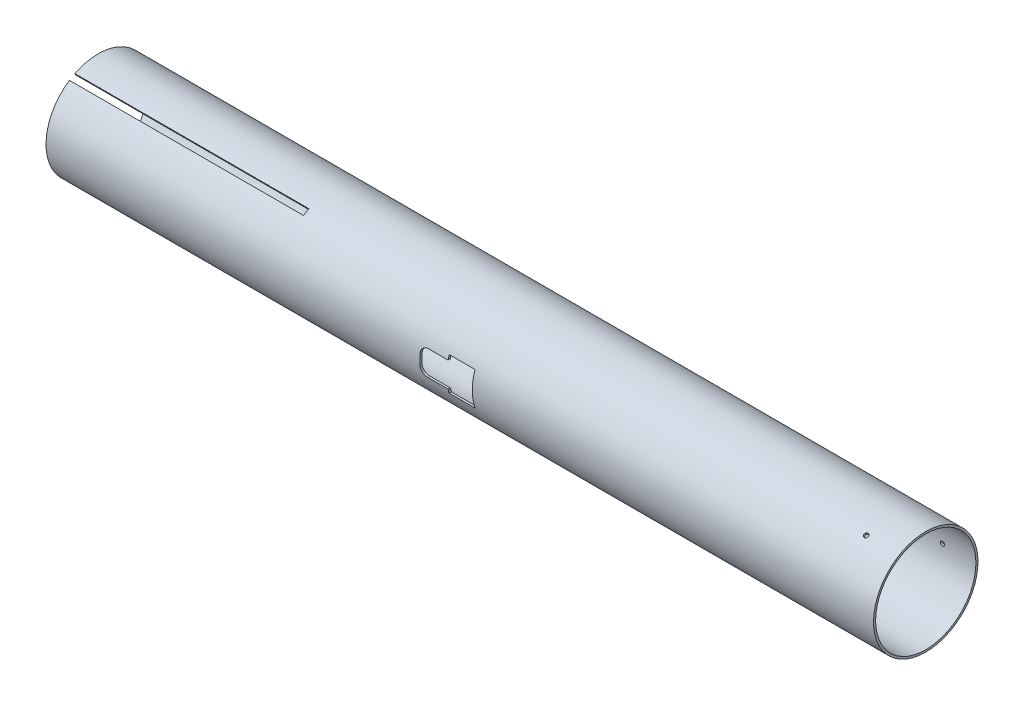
ISO-10303-21;
HEADER;
FILE_DESCRIPTION(('STEP AP214'),'2;1');
FILE_NAME('part.step','',(''),(''),'','','');
FILE_SCHEMA(('AUTOMOTIVE_DESIGN { 1 0 10303 214 1 1 1 1 }'));
ENDSEC;
DATA;
#1=APPLICATION_CONTEXT('core data for automotive mechanical design processes');
#2=APPLICATION_PROTOCOL_DEFINITION('international standard','automotive_design',2000,#1);
#3=PRODUCT_CONTEXT('',#1,'mechanical');
#4=PRODUCT('Part','Part','',(#3));
#5=PRODUCT_RELATED_PRODUCT_CATEGORY('part','',(#4));
#6=PRODUCT_DEFINITION_FORMATION('','',#4);
#7=PRODUCT_DEFINITION_CONTEXT('part definition',#1,'design');
#8=PRODUCT_DEFINITION('design','',#6,#7);
#9=PRODUCT_DEFINITION_SHAPE('','',#8);
#10=(LENGTH_UNIT() NAMED_UNIT(*) SI_UNIT(.MILLI.,.METRE.));
#11=(NAMED_UNIT(*) PLANE_ANGLE_UNIT() SI_UNIT($,.RADIAN.));
#12=(NAMED_UNIT(*) SI_UNIT($,.STERADIAN.) SOLID_ANGLE_UNIT());
#13=UNCERTAINTY_MEASURE_WITH_UNIT(LENGTH_MEASURE(1.E-05),#10,'distance_accuracy_value','');
#14=(GEOMETRIC_REPRESENTATION_CONTEXT(3) GLOBAL_UNCERTAINTY_ASSIGNED_CONTEXT((#13)) GLOBAL_UNIT_ASSIGNED_CONTEXT((#10,
#11,#12)) REPRESENTATION_CONTEXT('',''));
#15=CARTESIAN_POINT('',(0.,0.,0.));
#16=DIRECTION('',(0.,0.,1.));
#17=DIRECTION('',(1.,0.,0.));
#18=AXIS2_PLACEMENT_3D('',#15,#16,#17);
#19=CARTESIAN_POINT('',(628.65,0.,0.));
#20=DIRECTION('',(-1.,0.,0.));
#21=DIRECTION('',(0.,0.,1.));
#22=AXIS2_PLACEMENT_3D('',#19,#20,#21);
#23=CYLINDRICAL_SURFACE('',#22,39.6875);
#24=CARTESIAN_POINT('',(603.25,35.1366258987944,18.4530533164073));
#25=CARTESIAN_POINT('',(603.339132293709,35.1366242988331,18.4530569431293));
#26=CARTESIAN_POINT('',(603.428328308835,35.1331230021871,18.4597279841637));
#27=CARTESIAN_POINT('',(603.604261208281,35.1191832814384,18.4862337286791));
#28=CARTESIAN_POINT('',(603.690995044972,35.1087366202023,18.5060840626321));
#29=CARTESIAN_POINT('',(603.859429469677,35.081140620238,18.5583430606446));
#30=CARTESIAN_POINT('',(603.941132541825,35.0639946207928,18.5907454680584));
#31=CARTESIAN_POINT('',(604.097206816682,35.0233929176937,18.6671226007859));
#32=CARTESIAN_POINT('',(604.171579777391,34.9999387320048,18.7110945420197));
#33=CARTESIAN_POINT('',(604.31095723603,34.9472456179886,18.8093269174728));
#34=CARTESIAN_POINT('',(604.375956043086,34.9180032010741,18.8635935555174));
#35=CARTESIAN_POINT('',(604.494691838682,34.8544377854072,18.9807865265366));
#36=CARTESIAN_POINT('',(604.548428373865,34.8201145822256,19.0437132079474));
#37=CARTESIAN_POINT('',(604.643127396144,34.7472221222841,19.1763899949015));
#38=CARTESIAN_POINT('',(604.684085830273,34.7086515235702,19.2461422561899));
#39=CARTESIAN_POINT('',(604.752039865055,34.6282599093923,19.3904121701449));
#40=CARTESIAN_POINT('',(604.779035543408,34.5864389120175,19.464929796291));
#41=CARTESIAN_POINT('',(604.818283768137,34.5006816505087,19.6165286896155));
#42=CARTESIAN_POINT('',(604.830544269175,34.4567465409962,19.6936085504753));
#43=CARTESIAN_POINT('',(604.839998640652,34.367952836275,19.8481589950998));
#44=CARTESIAN_POINT('',(604.83719259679,34.3230942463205,19.9256295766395));
#45=CARTESIAN_POINT('',(604.81660017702,34.2337623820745,20.0787206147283));
#46=CARTESIAN_POINT('',(604.798822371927,34.1892889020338,20.1543421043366));
#47=CARTESIAN_POINT('',(604.748804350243,34.1020141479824,20.301665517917));
#48=CARTESIAN_POINT('',(604.716564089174,34.0592128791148,20.3733674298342));
#49=CARTESIAN_POINT('',(604.638526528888,33.9765719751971,20.5108912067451));
#50=CARTESIAN_POINT('',(604.592725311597,33.936733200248,20.5767113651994));
#51=CARTESIAN_POINT('',(604.4888688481,33.8612747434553,20.7006522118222));
#52=CARTESIAN_POINT('',(604.430813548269,33.8256550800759,20.7587728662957));
#53=CARTESIAN_POINT('',(604.304048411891,33.7597501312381,20.8657827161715));
#54=CARTESIAN_POINT('',(604.235331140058,33.7294686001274,20.9146654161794));
#55=CARTESIAN_POINT('',(604.089218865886,33.6752597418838,21.0018375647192));
#56=CARTESIAN_POINT('',(604.011823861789,33.6513324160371,21.0401270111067));
#57=CARTESIAN_POINT('',(603.850548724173,33.6106268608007,21.105091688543));
#58=CARTESIAN_POINT('',(603.766668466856,33.5938487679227,21.1317666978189));
#59=CARTESIAN_POINT('',(603.594805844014,33.5680078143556,21.1727915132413));
#60=CARTESIAN_POINT('',(603.506823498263,33.55894491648,21.1871413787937));
#61=CARTESIAN_POINT('',(603.329319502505,33.5488458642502,21.2031292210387));
#62=CARTESIAN_POINT('',(603.239798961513,33.5478041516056,21.2047760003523));
#63=CARTESIAN_POINT('',(603.061702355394,33.5537683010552,21.1953371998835));
#64=CARTESIAN_POINT('',(602.973126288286,33.5607741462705,21.1842516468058));
#65=CARTESIAN_POINT('',(602.799462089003,33.5825916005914,21.1496480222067));
#66=CARTESIAN_POINT('',(602.714372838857,33.5974006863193,21.1261339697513));
#67=CARTESIAN_POINT('',(602.550063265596,33.6343237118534,21.0672998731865));
#68=CARTESIAN_POINT('',(602.470842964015,33.6564376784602,21.0319797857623));
#69=CARTESIAN_POINT('',(602.320472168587,33.7072480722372,20.9504506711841));
#70=CARTESIAN_POINT('',(602.249326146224,33.7359481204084,20.9042356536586));
#71=CARTESIAN_POINT('',(602.117168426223,33.7989828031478,20.8021634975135));
#72=CARTESIAN_POINT('',(602.056156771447,33.8333174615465,20.7463063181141));
#73=CARTESIAN_POINT('',(601.945964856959,33.906538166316,20.6264212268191));
#74=CARTESIAN_POINT('',(601.896791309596,33.9454267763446,20.5623887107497));
#75=CARTESIAN_POINT('',(601.811717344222,34.0265156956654,20.4279230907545));
#76=CARTESIAN_POINT('',(601.775816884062,34.0687159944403,20.3574900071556));
#77=CARTESIAN_POINT('',(601.718319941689,34.1551203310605,20.2121881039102));
#78=CARTESIAN_POINT('',(601.696719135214,34.1993237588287,20.1373206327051));
#79=CARTESIAN_POINT('',(601.668420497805,34.2884285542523,19.9852217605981));
#80=CARTESIAN_POINT('',(601.661722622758,34.3333299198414,19.907990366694));
#81=CARTESIAN_POINT('',(601.663420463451,34.4225028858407,19.7534024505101));
#82=CARTESIAN_POINT('',(601.67180562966,34.4667749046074,19.6760460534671));
#83=CARTESIAN_POINT('',(601.703409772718,34.5534890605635,19.523364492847));
#84=CARTESIAN_POINT('',(601.726628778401,34.5959311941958,19.4480393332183));
#85=CARTESIAN_POINT('',(601.787239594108,34.6778483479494,19.3015941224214));
#86=CARTESIAN_POINT('',(601.824631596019,34.7173233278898,19.2304741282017));
#87=CARTESIAN_POINT('',(601.912524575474,34.7922864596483,19.0945147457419));
#88=CARTESIAN_POINT('',(601.963025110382,34.8277747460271,19.0296751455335));
#89=CARTESIAN_POINT('',(602.075737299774,34.8939046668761,18.9081429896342));
#90=CARTESIAN_POINT('',(602.137955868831,34.92454341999,18.8514552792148));
#91=CARTESIAN_POINT('',(602.272341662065,34.9802202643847,18.7479415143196));
#92=CARTESIAN_POINT('',(602.344511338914,35.0052569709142,18.7011178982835));
#93=CARTESIAN_POINT('',(602.496791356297,35.0491526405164,18.6187202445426));
#94=CARTESIAN_POINT('',(602.576907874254,35.0680067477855,18.5831550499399));
#95=CARTESIAN_POINT('',(602.742702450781,35.0990634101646,18.5244302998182));
#96=CARTESIAN_POINT('',(602.82837376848,35.1112738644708,18.5012560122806));
#97=CARTESIAN_POINT('',(602.970485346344,35.1255512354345,18.4741288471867));
#98=CARTESIAN_POINT('',(603.026004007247,35.1296999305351,18.4662360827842));
#99=CARTESIAN_POINT('',(603.137673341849,35.1352377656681,18.4556971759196));
#100=CARTESIAN_POINT('',(603.19382401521,35.1366269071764,18.4530510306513));
#101=CARTESIAN_POINT('',(603.25,35.1366258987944,18.4530533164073));
#102=B_SPLINE_CURVE_WITH_KNOTS('',3,(#24,#25,#26,#27,#28,#29,#30,#31,#32,#33,#34,#35,#36,#37,
#38,#39,#40,#41,#42,#43,#44,#45,#46,#47,#48,#49,#50,#51,#52,#53,#54,#55,#56,#57,#58,#59,#60,#61,
#62,#63,#64,#65,#66,#67,#68,#69,#70,#71,#72,#73,#74,#75,#76,#77,#78,#79,#80,#81,#82,#83,#84,#85,
#86,#87,#88,#89,#90,#91,#92,#93,#94,#95,#96,#97,#98,#99,#100,#101),.UNSPECIFIED.,.T.,.F.,(4,2,2,
2,2,2,2,2,2,2,2,2,2,2,2,2,2,2,2,2,2,2,2,2,2,2,2,2,2,2,2,2,2,2,2,2,2,2,4),(0.,0.267191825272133,
0.534701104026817,0.802077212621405,1.06938903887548,1.33686246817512,1.60434666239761,
1.87191561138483,2.13948307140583,2.4069060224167,2.67432745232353,2.94159589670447,
3.2088651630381,3.47621172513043,3.74355945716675,4.01109447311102,4.27862954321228,
4.54616972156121,4.81370861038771,5.08106209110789,5.34841501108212,5.61568152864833,
5.88294902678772,6.15036382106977,6.41777974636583,6.68534694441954,6.95291329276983,
7.2203986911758,7.48788329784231,7.75518089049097,8.02247900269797,8.28978073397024,
8.55707344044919,8.82452436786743,9.09204133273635,9.35976790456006,9.62717545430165,
9.79557426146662,9.96397297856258),.UNSPECIFIED.);
#103=CARTESIAN_POINT('',(603.25,35.1366258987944,18.4530533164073));
#104=VERTEX_POINT('',#103);
#105=EDGE_CURVE('E246',#104,#104,#102,.T.);
#106=ORIENTED_EDGE('',*,*,#105,.T.);
#107=EDGE_LOOP('',(#106));
#108=FACE_BOUND('',#107,.T.);
#109=CARTESIAN_POINT('',(603.25,-33.5491258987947,21.2026839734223));
#110=CARTESIAN_POINT('',(603.339132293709,-33.5491282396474,21.2026807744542));
#111=CARTESIAN_POINT('',(603.428328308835,-33.5531548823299,21.1963130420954));
#112=CARTESIAN_POINT('',(603.604261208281,-33.5691396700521,21.1709880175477));
#113=CARTESIAN_POINT('',(603.690995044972,-33.581107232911,21.152015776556));
#114=CARTESIAN_POINT('',(603.859429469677,-33.612566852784,21.1019874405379));
#115=CARTESIAN_POINT('',(603.941132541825,-33.6320551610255,21.0709373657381));
#116=CARTESIAN_POINT('',(604.097206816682,-33.6778988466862,20.9975866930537));
#117=CARTESIAN_POINT('',(604.171579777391,-33.7042525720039,20.9552888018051));
#118=CARTESIAN_POINT('',(604.31095723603,-33.7629777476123,20.860539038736));
#119=CARTESIAN_POINT('',(604.375956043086,-33.7953528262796,20.8080810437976));
#120=CARTESIAN_POINT('',(604.494691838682,-33.8650622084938,20.6944352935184));
#121=CARTESIAN_POINT('',(604.548428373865,-33.9023967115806,20.6332471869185));
#122=CARTESIAN_POINT('',(604.643127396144,-33.9808519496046,20.5037820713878));
#123=CARTESIAN_POINT('',(604.684085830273,-34.0219738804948,20.4355028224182));
#124=CARTESIAN_POINT('',(604.752039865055,-34.1067194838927,20.2937466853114));
#125=CARTESIAN_POINT('',(604.779035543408,-34.1503431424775,20.2202698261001));
#126=CARTESIAN_POINT('',(604.818283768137,-34.2387530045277,20.0702024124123));
#127=CARTESIAN_POINT('',(604.830544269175,-34.2835385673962,19.9936135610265));
#128=CARTESIAN_POINT('',(604.839998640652,-34.3729863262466,19.8394407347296));
#129=CARTESIAN_POINT('',(604.83719259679,-34.4176485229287,19.7618567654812));
#130=CARTESIAN_POINT('',(604.81660017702,-34.5055633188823,19.6079475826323));
#131=CARTESIAN_POINT('',(604.798822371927,-34.5488167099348,19.5316216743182));
#132=CARTESIAN_POINT('',(604.748804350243,-34.6327651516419,19.3823778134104));
#133=CARTESIAN_POINT('',(604.716564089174,-34.6734601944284,19.3094598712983));
#134=CARTESIAN_POINT('',(604.638526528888,-34.7512388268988,19.1691288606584));
#135=CARTESIAN_POINT('',(604.592725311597,-34.7883213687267,19.1017173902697));
#136=CARTESIAN_POINT('',(604.4888688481,-34.8579280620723,18.9743980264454));
#137=CARTESIAN_POINT('',(604.430813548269,-34.8904521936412,18.9144901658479));
#138=CARTESIAN_POINT('',(604.304048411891,-34.9501729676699,18.8039098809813));
#139=CARTESIAN_POINT('',(604.235331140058,-34.977365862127,18.75324395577));
#140=CARTESIAN_POINT('',(604.089218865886,-35.0257547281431,18.662711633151));
#141=CARTESIAN_POINT('',(604.011823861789,-35.0469506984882,18.6228452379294));
#142=CARTESIAN_POINT('',(603.850548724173,-35.0828589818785,18.5551108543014));
#143=CARTESIAN_POINT('',(603.766668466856,-35.0975711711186,18.527243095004));
#144=CARTESIAN_POINT('',(603.594805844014,-35.1201792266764,18.4843517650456));
#145=CARTESIAN_POINT('',(603.506823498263,-35.1280751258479,18.4693281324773));
#146=CARTESIAN_POINT('',(603.329319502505,-35.1368714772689,18.4525881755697));
#147=CARTESIAN_POINT('',(603.239798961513,-35.1377767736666,18.4508626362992));
#148=CARTESIAN_POINT('',(603.061702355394,-35.1325846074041,18.460747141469));
#149=CARTESIAN_POINT('',(602.973126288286,-35.1264871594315,18.4723571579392));
#150=CARTESIAN_POINT('',(602.799462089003,-35.1074282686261,18.5085534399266));
#151=CARTESIAN_POINT('',(602.714372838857,-35.0944690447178,18.5331355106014));
#152=CARTESIAN_POINT('',(602.550063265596,-35.0619787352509,18.5945288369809));
#153=CARTESIAN_POINT('',(602.470842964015,-35.0424476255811,18.6313401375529));
#154=CARTESIAN_POINT('',(602.320472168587,-34.9972465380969,18.7161077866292));
#155=CARTESIAN_POINT('',(602.249326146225,-34.971573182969,18.7640702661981));
#156=CARTESIAN_POINT('',(602.117168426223,-34.914693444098,18.8696959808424));
#157=CARTESIAN_POINT('',(602.056156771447,-34.8834870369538,18.9273592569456));
#158=CARTESIAN_POINT('',(601.945964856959,-34.816273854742,19.0507127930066));
#159=CARTESIAN_POINT('',(601.896791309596,-34.7802643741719,19.1164075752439));
#160=CARTESIAN_POINT('',(601.811717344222,-34.7043581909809,19.2538654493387));
#161=CARTESIAN_POINT('',(601.775816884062,-34.6644615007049,19.3256285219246));
#162=CARTESIAN_POINT('',(601.718319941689,-34.5818285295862,19.4731078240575));
#163=CARTESIAN_POINT('',(601.696719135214,-34.5390931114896,19.5488228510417));
#164=CARTESIAN_POINT('',(601.668420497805,-34.4519240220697,19.702039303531));
#165=CARTESIAN_POINT('',(601.661722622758,-34.4074903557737,19.7795407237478));
#166=CARTESIAN_POINT('',(601.663420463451,-34.3181997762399,19.934060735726));
#167=CARTESIAN_POINT('',(601.67180562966,-34.2733431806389,20.0110796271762));
#168=CARTESIAN_POINT('',(601.703409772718,-34.1844741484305,20.162517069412));
#169=CARTESIAN_POINT('',(601.726628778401,-34.1404617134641,20.2369356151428));
#170=CARTESIAN_POINT('',(601.787239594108,-34.0545950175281,20.3811005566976));
#171=CARTESIAN_POINT('',(601.824631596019,-34.012740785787,20.4508468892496));
#172=CARTESIAN_POINT('',(601.912524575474,-33.9324780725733,20.5837465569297));
#173=CARTESIAN_POINT('',(601.963025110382,-33.894069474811,20.6469001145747));
#174=CARTESIAN_POINT('',(602.075737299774,-33.82188450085,20.7649363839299));
#175=CARTESIAN_POINT('',(602.137955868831,-33.7881108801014,20.8198141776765));
#176=CARTESIAN_POINT('',(602.272341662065,-33.7263037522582,20.9197886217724));
#177=CARTESIAN_POINT('',(602.344511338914,-33.6982716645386,20.9648828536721));
#178=CARTESIAN_POINT('',(602.496791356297,-33.6488610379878,21.0440964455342));
#179=CARTESIAN_POINT('',(602.576907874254,-33.6274877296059,21.0782071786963));
#180=CARTESIAN_POINT('',(602.742702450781,-33.5921589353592,21.1344654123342));
#181=CARTESIAN_POINT('',(602.82837376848,-33.5781946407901,21.1566271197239));
#182=CARTESIAN_POINT('',(602.970485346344,-33.5618405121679,21.1825552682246));
#183=CARTESIAN_POINT('',(603.026004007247,-33.5570795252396,21.1900945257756));
#184=CARTESIAN_POINT('',(603.137673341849,-33.5507214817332,21.200159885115));
#185=CARTESIAN_POINT('',(603.19382401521,-33.549124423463,21.2026859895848));
#186=CARTESIAN_POINT('',(603.25,-33.5491258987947,21.2026839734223));
#187=B_SPLINE_CURVE_WITH_KNOTS('',3,(#109,#110,#111,#112,#113,#114,#115,#116,#117,#118,#119,
#120,#121,#122,#123,#124,#125,#126,#127,#128,#129,#130,#131,#132,#133,#134,#135,#136,#137,#138,
#139,#140,#141,#142,#143,#144,#145,#146,#147,#148,#149,#150,#151,#152,#153,#154,#155,#156,#157,
#158,#159,#160,#161,#162,#163,#164,#165,#166,#167,#168,#169,#170,#171,#172,#173,#174,#175,#176,
#177,#178,#179,#180,#181,#182,#183,#184,#185,#186),.UNSPECIFIED.,.T.,.F.,(4,2,2,2,2,2,2,2,2,2,2,
2,2,2,2,2,2,2,2,2,2,2,2,2,2,2,2,2,2,2,2,2,2,2,2,2,2,2,4),(0.,0.267191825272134,
0.534701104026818,0.802077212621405,1.06938903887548,1.33686246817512,1.60434666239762,
1.87191561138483,2.13948307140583,2.4069060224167,2.67432745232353,2.94159589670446,
3.20886516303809,3.47621172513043,3.74355945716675,4.01109447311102,4.27862954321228,
4.54616972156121,4.81370861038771,5.0810620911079,5.34841501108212,5.61568152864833,
5.88294902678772,6.15036382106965,6.41777974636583,6.68534694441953,6.95291329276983,
7.22039869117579,7.48788329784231,7.75518089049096,8.02247900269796,8.28978073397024,
8.55707344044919,8.82452436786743,9.09204133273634,9.35976790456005,9.62717545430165,
9.79557426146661,9.96397297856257),.UNSPECIFIED.);
#188=CARTESIAN_POINT('',(603.25,-33.5491258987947,21.2026839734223));
#189=VERTEX_POINT('',#188);
#190=EDGE_CURVE('E239',#189,#189,#187,.T.);
#191=ORIENTED_EDGE('',*,*,#190,.T.);
#192=EDGE_LOOP('',(#191));
#193=FACE_BOUND('',#192,.T.);
#194=CARTESIAN_POINT('',(604.8375,0.,-39.6875));
#195=CARTESIAN_POINT('',(604.837496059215,0.0891323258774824,-39.6874995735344));
#196=CARTESIAN_POINT('',(604.829968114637,0.178328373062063,-39.6871965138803));
#197=CARTESIAN_POINT('',(604.800043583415,0.354261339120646,-39.6860166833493));
#198=CARTESIAN_POINT('',(604.777629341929,0.440995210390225,-39.6851392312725));
#199=CARTESIAN_POINT('',(604.718573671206,0.609429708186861,-39.6829099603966));
#200=CARTESIAN_POINT('',(604.681939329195,0.691132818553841,-39.681558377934));
#201=CARTESIAN_POINT('',(604.595493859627,0.847207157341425,-39.6785331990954));
#202=CARTESIAN_POINT('',(604.545685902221,0.921580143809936,-39.6768596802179));
#203=CARTESIAN_POINT('',(604.434267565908,1.06095757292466,-39.6733776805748));
#204=CARTESIAN_POINT('',(604.372650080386,1.12595633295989,-39.6715691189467));
#205=CARTESIAN_POINT('',(604.239375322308,1.24469203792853,-39.6680215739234));
#206=CARTESIAN_POINT('',(604.167717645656,1.29842852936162,-39.6662825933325));
#207=CARTESIAN_POINT('',(604.016369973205,1.39312750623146,-39.663069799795));
#208=CARTESIAN_POINT('',(603.93667743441,1.43408593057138,-39.6615960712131));
#209=CARTESIAN_POINT('',(603.771540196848,1.50203994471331,-39.6590808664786));
#210=CARTESIAN_POINT('',(603.686095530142,1.52903561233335,-39.6580393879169));
#211=CARTESIAN_POINT('',(603.511928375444,1.56828381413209,-39.656506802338));
#212=CARTESIAN_POINT('',(603.423207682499,1.58054430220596,-39.6560153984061));
#213=CARTESIAN_POINT('',(603.244966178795,1.5899986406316,-39.6556374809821));
#214=CARTESIAN_POINT('',(603.155445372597,1.58719257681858,-39.6557509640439));
#215=CARTESIAN_POINT('',(602.978198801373,1.56660012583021,-39.6565697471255));
#216=CARTESIAN_POINT('',(602.890472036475,1.54882232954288,-39.6572747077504));
#217=CARTESIAN_POINT('',(602.719249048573,1.49880436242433,-39.6591964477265));
#218=CARTESIAN_POINT('',(602.635752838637,1.46656414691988,-39.6604132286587));
#219=CARTESIAN_POINT('',(602.475333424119,1.38852668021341,-39.6632218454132));
#220=CARTESIAN_POINT('',(602.398412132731,1.34272550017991,-39.664813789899));
#221=CARTESIAN_POINT('',(602.253347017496,1.23886911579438,-39.6681931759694));
#222=CARTESIAN_POINT('',(602.185203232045,1.18081385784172,-39.6699806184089));
#223=CARTESIAN_POINT('',(602.059577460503,1.0540487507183,-39.6735510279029));
#224=CARTESIAN_POINT('',(602.002102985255,0.985331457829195,-39.6753339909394));
#225=CARTESIAN_POINT('',(601.899505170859,0.839219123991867,-39.6786932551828));
#226=CARTESIAN_POINT('',(601.854381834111,0.761824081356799,-39.6802695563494));
#227=CARTESIAN_POINT('',(601.777767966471,0.600548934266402,-39.6830378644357));
#228=CARTESIAN_POINT('',(601.746277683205,0.516668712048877,-39.6842298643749));
#229=CARTESIAN_POINT('',(601.697828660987,0.34480616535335,-39.6860951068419));
#230=CARTESIAN_POINT('',(601.680869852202,0.256823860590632,-39.6867683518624));
#231=CARTESIAN_POINT('',(601.661974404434,0.0793198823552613,-39.6875198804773));
#232=CARTESIAN_POINT('',(601.660027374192,-0.0102006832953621,-39.6875985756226));
#233=CARTESIAN_POINT('',(601.67118365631,-0.18829734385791,-39.6871532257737));
#234=CARTESIAN_POINT('',(601.684286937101,-0.27687344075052,-39.6866291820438));
#235=CARTESIAN_POINT('',(601.725163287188,-0.450537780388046,-39.6850376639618));
#236=CARTESIAN_POINT('',(601.752931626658,-0.53562713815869,-39.6839703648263));
#237=CARTESIAN_POINT('',(601.822345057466,-0.699936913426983,-39.6814125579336));
#238=CARTESIAN_POINT('',(601.863990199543,-0.779157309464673,-39.679922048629));
#239=CARTESIAN_POINT('',(601.960001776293,-0.929528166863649,-39.6766846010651));
#240=CARTESIAN_POINT('',(602.014375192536,-1.00067416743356,-39.674937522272));
#241=CARTESIAN_POINT('',(602.13428962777,-1.1328318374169,-39.6713842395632));
#242=CARTESIAN_POINT('',(602.199830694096,-1.19384346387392,-39.669578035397));
#243=CARTESIAN_POINT('',(602.340264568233,-1.30403532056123,-39.6661089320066));
#244=CARTESIAN_POINT('',(602.415162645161,-1.35320883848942,-39.6644461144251));
#245=CARTESIAN_POINT('',(602.572157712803,-1.43828275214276,-39.6614525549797));
#246=CARTESIAN_POINT('',(602.654254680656,-1.47418319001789,-39.6601218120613));
#247=CARTESIAN_POINT('',(602.823292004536,-1.53168011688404,-39.6579430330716));
#248=CARTESIAN_POINT('',(602.91023089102,-1.55328092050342,-39.6570948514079));
#249=CARTESIAN_POINT('',(603.086504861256,-1.58157953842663,-39.6559764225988));
#250=CARTESIAN_POINT('',(603.17583993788,-1.5882773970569,-39.6557061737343));
#251=CARTESIAN_POINT('',(603.354303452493,-1.58657950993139,-39.6557741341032));
#252=CARTESIAN_POINT('',(603.443431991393,-1.57819433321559,-39.6561119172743));
#253=CARTESIAN_POINT('',(603.619015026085,-1.54659019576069,-39.6573569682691));
#254=CARTESIAN_POINT('',(603.705469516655,-1.52337120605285,-39.658264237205));
#255=CARTESIAN_POINT('',(603.873253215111,-1.46276045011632,-39.6605459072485));
#256=CARTESIAN_POINT('',(603.954582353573,-1.42536849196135,-39.661920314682));
#257=CARTESIAN_POINT('',(604.109808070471,-1.33747562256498,-39.664981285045));
#258=CARTESIAN_POINT('',(604.183704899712,-1.28697515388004,-39.6666678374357));
#259=CARTESIAN_POINT('',(604.322019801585,-1.17426303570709,-39.6701642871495));
#260=CARTESIAN_POINT('',(604.386432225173,-1.11204445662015,-39.6719742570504));
#261=CARTESIAN_POINT('',(604.503916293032,-0.977658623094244,-39.67551320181));
#262=CARTESIAN_POINT('',(604.556985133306,-0.905488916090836,-39.6772421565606));
#263=CARTESIAN_POINT('',(604.650291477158,-0.753208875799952,-39.6804250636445));
#264=CARTESIAN_POINT('',(604.690518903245,-0.673092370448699,-39.6818787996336));
#265=CARTESIAN_POINT('',(604.756904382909,-0.507297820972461,-39.6843438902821));
#266=CARTESIAN_POINT('',(604.783079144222,-0.421626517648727,-39.6853557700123));
#267=CARTESIAN_POINT('',(604.813710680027,-0.279514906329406,-39.6865539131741));
#268=CARTESIAN_POINT('',(604.82262037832,-0.223996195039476,-39.6869071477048));
#269=CARTESIAN_POINT('',(604.834516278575,-0.112326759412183,-39.6873803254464));
#270=CARTESIAN_POINT('',(604.837502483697,-0.0561760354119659,-39.6875002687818));
#271=CARTESIAN_POINT('',(604.8375,0.,-39.6875));
#272=B_SPLINE_CURVE_WITH_KNOTS('',3,(#194,#195,#196,#197,#198,#199,#200,#201,#202,#203,#204,
#205,#206,#207,#208,#209,#210,#211,#212,#213,#214,#215,#216,#217,#218,#219,#220,#221,#222,#223,
#224,#225,#226,#227,#228,#229,#230,#231,#232,#233,#234,#235,#236,#237,#238,#239,#240,#241,#242,
#243,#244,#245,#246,#247,#248,#249,#250,#251,#252,#253,#254,#255,#256,#257,#258,#259,#260,#261,
#262,#263,#264,#265,#266,#267,#268,#269,#270,#271),.UNSPECIFIED.,.T.,.F.,(4,2,2,2,2,2,2,2,2,2,2,
2,2,2,2,2,2,2,2,2,2,2,2,2,2,2,2,2,2,2,2,2,2,2,2,2,2,2,4),(0.,0.267191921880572,
0.534701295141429,0.802077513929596,1.06938944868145,1.33686275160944,1.60434682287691,
1.87191581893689,2.13948332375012,2.40690633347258,2.67432781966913,2.94159596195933,
3.20886492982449,3.47621140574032,3.74355905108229,4.01109419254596,4.27862938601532,
4.54616943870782,4.81370820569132,5.08106176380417,5.34841476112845,5.61568158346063,
5.88294938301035,6.15036412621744,6.4177800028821,6.68534715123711,6.95291344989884,
7.22039897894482,7.48788371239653,7.75518108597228,8.02247898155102,8.28978049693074,
8.55707298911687,8.82452404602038,9.09204113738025,9.35976765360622,9.62717515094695,
9.79557410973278,9.96397297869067),.UNSPECIFIED.);
#273=CARTESIAN_POINT('',(604.8375,0.,-39.6875));
#274=VERTEX_POINT('',#273);
#275=EDGE_CURVE('E436',#274,#274,#272,.T.);
#276=ORIENTED_EDGE('',*,*,#275,.T.);
#277=EDGE_LOOP('',(#276));
#278=FACE_BOUND('',#277,.T.);
#279=CARTESIAN_POINT('',(628.65,0.,0.));
#280=DIRECTION('',(1.,0.,0.));
#281=DIRECTION('',(0.,0.,-1.));
#282=AXIS2_PLACEMENT_3D('',#279,#280,#281);
#283=CIRCLE('',#282,39.6875);
#284=CARTESIAN_POINT('',(628.65,0.,-39.6875));
#285=VERTEX_POINT('',#284);
#286=EDGE_CURVE('E414',#285,#285,#283,.T.);
#287=ORIENTED_EDGE('',*,*,#286,.F.);
#288=EDGE_LOOP('',(#287));
#289=FACE_BOUND('',#288,.T.);
#290=CARTESIAN_POINT('',(177.8,0.,0.));
#291=DIRECTION('',(1.,0.,0.));
#292=DIRECTION('',(0.,0.,-1.));
#293=AXIS2_PLACEMENT_3D('',#290,#291,#292);
#294=CIRCLE('',#293,39.6875);
#295=CARTESIAN_POINT('',(177.8,35.4990857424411,17.7457760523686));
#296=VERTEX_POINT('',#295);
#297=CARTESIAN_POINT('',(177.8,33.117835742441,21.870222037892));
#298=VERTEX_POINT('',#297);
#299=EDGE_CURVE('E234',#296,#298,#294,.T.);
#300=ORIENTED_EDGE('',*,*,#299,.T.);
#301=DIRECTION('',(-1.,0.,0.));
#302=VECTOR('',#301,1.);
#303=CARTESIAN_POINT('',(628.65,33.117835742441,21.870222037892));
#304=LINE('',#303,#302);
#305=CARTESIAN_POINT('',(0.,33.117835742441,21.870222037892));
#306=VERTEX_POINT('',#305);
#307=EDGE_CURVE('E235',#298,#306,#304,.T.);
#308=ORIENTED_EDGE('',*,*,#307,.T.);
#309=CARTESIAN_POINT('',(0.,0.,0.));
#310=DIRECTION('',(1.,0.,0.));
#311=DIRECTION('',(0.,0.,-1.));
#312=AXIS2_PLACEMENT_3D('',#309,#310,#311);
#313=CIRCLE('',#312,39.6875);
#314=CARTESIAN_POINT('',(0.,-33.1178357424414,21.8702220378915));
#315=VERTEX_POINT('',#314);
#316=EDGE_CURVE('E424',#306,#315,#313,.T.);
#317=ORIENTED_EDGE('',*,*,#316,.T.);
#318=DIRECTION('',(-1.,0.,0.));
#319=VECTOR('',#318,1.);
#320=CARTESIAN_POINT('',(628.65,-33.1178357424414,21.8702220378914));
#321=LINE('',#320,#319);
#322=CARTESIAN_POINT('',(177.8,-33.1178357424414,21.8702220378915));
#323=VERTEX_POINT('',#322);
#324=EDGE_CURVE('E215',#315,#323,#321,.F.);
#325=ORIENTED_EDGE('',*,*,#324,.T.);
#326=CARTESIAN_POINT('',(177.8,-35.4990857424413,17.7457760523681));
#327=VERTEX_POINT('',#326);
#328=EDGE_CURVE('E231',#323,#327,#294,.T.);
#329=ORIENTED_EDGE('',*,*,#328,.T.);
#330=DIRECTION('',(-1.,0.,0.));
#331=VECTOR('',#330,1.);
#332=CARTESIAN_POINT('',(628.65,-35.4990857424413,17.7457760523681));
#333=LINE('',#332,#331);
#334=CARTESIAN_POINT('',(0.,-35.4990857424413,17.7457760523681));
#335=VERTEX_POINT('',#334);
#336=EDGE_CURVE('E225',#327,#335,#333,.T.);
#337=ORIENTED_EDGE('',*,*,#336,.T.);
#338=CARTESIAN_POINT('',(0.,-2.38125,-39.6159980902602));
#339=VERTEX_POINT('',#338);
#340=EDGE_CURVE('E426',#335,#339,#313,.T.);
#341=ORIENTED_EDGE('',*,*,#340,.T.);
#342=DIRECTION('',(-1.,0.,0.));
#343=VECTOR('',#342,1.);
#344=CARTESIAN_POINT('',(628.65,-2.38124999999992,-39.6159980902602));
#345=LINE('',#344,#343);
#346=CARTESIAN_POINT('',(177.8,-2.38124999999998,-39.6159980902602));
#347=VERTEX_POINT('',#346);
#348=EDGE_CURVE('E446',#339,#347,#345,.F.);
#349=ORIENTED_EDGE('',*,*,#348,.T.);
#350=CARTESIAN_POINT('',(177.8,0.,0.));
#351=DIRECTION('',(1.,0.,0.));
#352=DIRECTION('',(0.,0.,-1.));
#353=AXIS2_PLACEMENT_3D('',#350,#351,#352);
#354=CIRCLE('',#353,39.6875);
#355=CARTESIAN_POINT('',(177.8,2.38125000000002,-39.6159980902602));
#356=VERTEX_POINT('',#355);
#357=EDGE_CURVE('E444',#347,#356,#354,.T.);
#358=ORIENTED_EDGE('',*,*,#357,.T.);
#359=DIRECTION('',(-1.,0.,0.));
#360=VECTOR('',#359,1.);
#361=CARTESIAN_POINT('',(628.65,2.38125000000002,-39.6159980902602));
#362=LINE('',#361,#360);
#363=CARTESIAN_POINT('',(0.,2.38125000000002,-39.6159980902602));
#364=VERTEX_POINT('',#363);
#365=EDGE_CURVE('E441',#356,#364,#362,.T.);
#366=ORIENTED_EDGE('',*,*,#365,.T.);
#367=CARTESIAN_POINT('',(0.,35.4990857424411,17.7457760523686));
#368=VERTEX_POINT('',#367);
#369=EDGE_CURVE('E420',#364,#368,#313,.T.);
#370=ORIENTED_EDGE('',*,*,#369,.T.);
#371=DIRECTION('',(-1.,0.,0.));
#372=VECTOR('',#371,1.);
#373=CARTESIAN_POINT('',(628.65,35.499085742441,17.7457760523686));
#374=LINE('',#373,#372);
#375=EDGE_CURVE('E228',#368,#296,#374,.F.);
#376=ORIENTED_EDGE('',*,*,#375,.T.);
#377=EDGE_LOOP('',(#300,#308,#317,#325,#329,#337,#341,#349,#358,#366,#370,#376));
#378=FACE_BOUND('',#377,.T.);
#379=CARTESIAN_POINT('',(323.85,0.,0.));
#380=DIRECTION('',(-1.,0.,0.));
#381=DIRECTION('',(0.,0.,1.));
#382=AXIS2_PLACEMENT_3D('',#379,#380,#381);
#383=CIRCLE('',#382,39.6875);
#384=CARTESIAN_POINT('',(323.85,-12.7,37.6006337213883));
#385=VERTEX_POINT('',#384);
#386=CARTESIAN_POINT('',(323.85,12.7,37.6006337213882));
#387=VERTEX_POINT('',#386);
#388=EDGE_CURVE('E194',#385,#387,#383,.T.);
#389=ORIENTED_EDGE('',*,*,#388,.F.);
#390=DIRECTION('',(-1.,0.,0.));
#391=VECTOR('',#390,1.);
#392=CARTESIAN_POINT('',(628.65,-12.7,37.6006337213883));
#393=LINE('',#392,#391);
#394=CARTESIAN_POINT('',(304.292,-12.7,37.6006337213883));
#395=VERTEX_POINT('',#394);
#396=EDGE_CURVE('E189',#395,#385,#393,.F.);
#397=ORIENTED_EDGE('',*,*,#396,.F.);
#398=CARTESIAN_POINT('',(304.292,0.,0.));
#399=DIRECTION('',(1.,0.,0.));
#400=DIRECTION('',(0.,0.,-1.));
#401=AXIS2_PLACEMENT_3D('',#398,#399,#400);
#402=CIRCLE('',#401,39.6875);
#403=CARTESIAN_POINT('',(304.292,-9.52499999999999,38.5275489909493));
#404=VERTEX_POINT('',#403);
#405=EDGE_CURVE('E177',#404,#395,#402,.T.);
#406=ORIENTED_EDGE('',*,*,#405,.F.);
#407=DIRECTION('',(-1.,0.,0.));
#408=VECTOR('',#407,1.);
#409=CARTESIAN_POINT('',(628.65,-9.52499999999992,38.5275489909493));
#410=LINE('',#409,#408);
#411=CARTESIAN_POINT('',(289.052,-9.52499999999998,38.5275489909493));
#412=VERTEX_POINT('',#411);
#413=EDGE_CURVE('E182',#412,#404,#410,.F.);
#414=ORIENTED_EDGE('',*,*,#413,.F.);
#415=CARTESIAN_POINT('',(283.972,-4.445,39.4377944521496));
#416=CARTESIAN_POINT('',(283.971984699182,-4.58923486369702,39.421545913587));
#417=CARTESIAN_POINT('',(283.978142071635,-4.73337194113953,39.4044912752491));
#418=CARTESIAN_POINT('',(284.002643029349,-5.02041050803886,39.3689455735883));
#419=CARTESIAN_POINT('',(284.020985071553,-5.16331215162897,39.3504546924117));
#420=CARTESIAN_POINT('',(284.069668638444,-5.44671578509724,39.3122298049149));
#421=CARTESIAN_POINT('',(284.09999650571,-5.58722031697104,39.2924972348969));
#422=CARTESIAN_POINT('',(284.17239448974,-5.86501784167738,39.2519924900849));
#423=CARTESIAN_POINT('',(284.214464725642,-6.00231080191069,39.2312203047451));
#424=CARTESIAN_POINT('',(284.310019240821,-6.27272576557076,39.1888925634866));
#425=CARTESIAN_POINT('',(284.363502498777,-6.40584814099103,39.1673370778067));
#426=CARTESIAN_POINT('',(284.481515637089,-6.66707605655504,39.1237178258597));
#427=CARTESIAN_POINT('',(284.546049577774,-6.79517973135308,39.1016538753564));
#428=CARTESIAN_POINT('',(284.685675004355,-7.04540901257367,39.0573425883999));
#429=CARTESIAN_POINT('',(284.760763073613,-7.1675365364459,39.0350953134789));
#430=CARTESIAN_POINT('',(284.92102918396,-7.40506997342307,38.9907322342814));
#431=CARTESIAN_POINT('',(285.006210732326,-7.52047352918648,38.9686164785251));
#432=CARTESIAN_POINT('',(285.18676612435,-7.74458051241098,38.9246999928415));
#433=CARTESIAN_POINT('',(285.282213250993,-7.85322564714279,38.9029029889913));
#434=CARTESIAN_POINT('',(285.482112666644,-8.06207038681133,38.8601600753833));
#435=CARTESIAN_POINT('',(285.586564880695,-8.1622700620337,38.8392141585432));
#436=CARTESIAN_POINT('',(285.803810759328,-8.35353140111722,38.7985274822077));
#437=CARTESIAN_POINT('',(285.916607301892,-8.44458988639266,38.7787871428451));
#438=CARTESIAN_POINT('',(286.149699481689,-8.61681517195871,38.7408818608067));
#439=CARTESIAN_POINT('',(286.269992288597,-8.69798567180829,38.7227163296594));
#440=CARTESIAN_POINT('',(286.516395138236,-8.84930013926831,38.6884158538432));
#441=CARTESIAN_POINT('',(286.642457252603,-8.91951903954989,38.6722672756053));
#442=CARTESIAN_POINT('',(286.900258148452,-9.04904267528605,38.6421648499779));
#443=CARTESIAN_POINT('',(287.031994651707,-9.10835174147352,38.6282101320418));
#444=CARTESIAN_POINT('',(287.300179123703,-9.21557251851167,38.6027708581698));
#445=CARTESIAN_POINT('',(287.436624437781,-9.26349053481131,38.5912849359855));
#446=CARTESIAN_POINT('',(287.713230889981,-9.34755000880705,38.5710102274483));
#447=CARTESIAN_POINT('',(287.853390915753,-9.38369494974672,38.5622206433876));
#448=CARTESIAN_POINT('',(288.168480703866,-9.45072047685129,38.545855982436));
#449=CARTESIAN_POINT('',(288.344110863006,-9.47856612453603,38.5390040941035));
#450=CARTESIAN_POINT('',(288.608916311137,-9.50641896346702,38.5321389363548));
#451=CARTESIAN_POINT('',(288.697375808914,-9.51338396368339,38.5304193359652));
#452=CARTESIAN_POINT('',(288.874550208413,-9.52267425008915,38.5281240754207));
#453=CARTESIAN_POINT('',(288.963265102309,-9.52499967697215,38.5275483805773));
#454=CARTESIAN_POINT('',(289.052,-9.52499999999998,38.5275489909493));
#455=B_SPLINE_CURVE_WITH_KNOTS('',3,(#415,#416,#417,#418,#419,#420,#421,#422,#423,#424,#425,
#426,#427,#428,#429,#430,#431,#432,#433,#434,#435,#436,#437,#438,#439,#440,#441,#442,#443,#444,
#445,#446,#447,#448,#449,#450,#451,#452,#453,#454),.UNSPECIFIED.,.F.,.F.,(4,2,2,2,2,2,2,2,2,2,2,
2,2,2,2,2,2,2,2,4),(0.,0.435298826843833,0.870542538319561,1.30529172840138,1.74004532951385,
2.1747600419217,2.60963482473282,3.04436915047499,3.4792549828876,3.91748222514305,
4.35570581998,4.79408127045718,5.23229219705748,5.66735913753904,6.10225300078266,
6.53690556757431,6.97142941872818,7.50413665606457,7.7702772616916,8.03640979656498),.UNSPECIFIED.);
#456=CARTESIAN_POINT('',(283.972,-4.445,39.4377944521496));
#457=VERTEX_POINT('',#456);
#458=EDGE_CURVE('E321',#457,#412,#455,.T.);
#459=ORIENTED_EDGE('',*,*,#458,.F.);
#460=CARTESIAN_POINT('',(283.972,0.,0.));
#461=DIRECTION('',(1.,0.,0.));
#462=DIRECTION('',(0.,0.,-1.));
#463=AXIS2_PLACEMENT_3D('',#460,#461,#462);
#464=CIRCLE('',#463,39.6875);
#465=CARTESIAN_POINT('',(283.972,4.44499999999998,39.4377944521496));
#466=VERTEX_POINT('',#465);
#467=EDGE_CURVE('E327',#466,#457,#464,.T.);
#468=ORIENTED_EDGE('',*,*,#467,.F.);
#469=CARTESIAN_POINT('',(289.052,9.52499999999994,38.5275489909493));
#470=CARTESIAN_POINT('',(288.911684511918,9.52501754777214,38.5275387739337));
#471=CARTESIAN_POINT('',(288.771373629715,9.51918725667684,38.5289858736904));
#472=CARTESIAN_POINT('',(288.491789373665,9.49595931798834,38.5347204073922));
#473=CARTESIAN_POINT('',(288.352515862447,9.47856323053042,38.5390074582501));
#474=CARTESIAN_POINT('',(288.076243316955,9.43237326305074,38.550337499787));
#475=CARTESIAN_POINT('',(287.939240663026,9.4035998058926,38.5573755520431));
#476=CARTESIAN_POINT('',(287.668225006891,9.33489837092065,38.5740662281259));
#477=CARTESIAN_POINT('',(287.534212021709,9.29497032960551,38.5837188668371));
#478=CARTESIAN_POINT('',(287.270127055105,9.20428759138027,38.6054518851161));
#479=CARTESIAN_POINT('',(287.140054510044,9.1535344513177,38.617531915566));
#480=CARTESIAN_POINT('',(286.88466504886,9.04157549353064,38.6438983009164));
#481=CARTESIAN_POINT('',(286.759349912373,8.98036581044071,38.6581854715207));
#482=CARTESIAN_POINT('',(286.514383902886,8.84798574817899,38.6886987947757));
#483=CARTESIAN_POINT('',(286.394731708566,8.77681770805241,38.7049244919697));
#484=CARTESIAN_POINT('',(286.161788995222,8.62500192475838,38.7390378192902));
#485=CARTESIAN_POINT('',(286.048500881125,8.54435063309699,38.7569260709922));
#486=CARTESIAN_POINT('',(285.827319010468,8.37281432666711,38.7943482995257));
#487=CARTESIAN_POINT('',(285.71953844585,8.28178802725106,38.8139037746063));
#488=CARTESIAN_POINT('',(285.511984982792,8.09117033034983,38.8540874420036));
#489=CARTESIAN_POINT('',(285.412215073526,7.99157576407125,38.8747160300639));
#490=CARTESIAN_POINT('',(285.221367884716,7.78453120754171,38.9167042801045));
#491=CARTESIAN_POINT('',(285.130289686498,7.67708204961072,38.9380638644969));
#492=CARTESIAN_POINT('',(284.95738301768,7.45504072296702,38.9811859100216));
#493=CARTESIAN_POINT('',(284.875557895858,7.34044599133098,39.0029485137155));
#494=CARTESIAN_POINT('',(284.641375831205,6.98180171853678,39.0693207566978));
#495=CARTESIAN_POINT('',(284.504487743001,6.72741464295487,39.1140808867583));
#496=CARTESIAN_POINT('',(284.275735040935,6.1990167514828,39.201294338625));
#497=CARTESIAN_POINT('',(284.183844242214,5.92501745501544,39.2437489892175));
#498=CARTESIAN_POINT('',(284.068121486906,5.44902565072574,39.3121480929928));
#499=CARTESIAN_POINT('',(284.032144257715,5.2500752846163,39.3392262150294));
#500=CARTESIAN_POINT('',(283.98407516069,4.84917356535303,39.390665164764));
#501=CARTESIAN_POINT('',(283.971959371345,4.64722542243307,39.4150286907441));
#502=CARTESIAN_POINT('',(283.972,4.44499999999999,39.4377944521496));
#503=B_SPLINE_CURVE_WITH_KNOTS('',3,(#469,#470,#471,#472,#473,#474,#475,#476,#477,#478,#479,
#480,#481,#482,#483,#484,#485,#486,#487,#488,#489,#490,#491,#492,#493,#494,#495,#496,#497,#498,
#499,#500,#501,#502),.UNSPECIFIED.,.F.,.F.,(4,2,2,2,2,2,2,2,2,2,2,2,2,2,2,2,4),(0.,
0.4208109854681,0.841565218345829,1.26156758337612,1.68157233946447,2.10151673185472,
2.52161669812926,2.94161815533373,3.36177727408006,3.78855991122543,4.21550106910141,
4.64239705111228,5.06944703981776,5.94199614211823,6.81403688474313,7.42461421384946,
8.03457911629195),.UNSPECIFIED.);
#504=CARTESIAN_POINT('',(289.052,9.52499999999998,38.5275489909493));
#505=VERTEX_POINT('',#504);
#506=EDGE_CURVE('E329',#505,#466,#503,.T.);
#507=ORIENTED_EDGE('',*,*,#506,.F.);
#508=DIRECTION('',(-1.,0.,0.));
#509=VECTOR('',#508,1.);
#510=CARTESIAN_POINT('',(628.65,9.52500000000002,38.5275489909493));
#511=LINE('',#510,#509);
#512=CARTESIAN_POINT('',(304.292,9.52499999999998,38.5275489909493));
#513=VERTEX_POINT('',#512);
#514=EDGE_CURVE('E334',#513,#505,#511,.T.);
#515=ORIENTED_EDGE('',*,*,#514,.F.);
#516=CARTESIAN_POINT('',(304.292,0.,0.));
#517=DIRECTION('',(1.,0.,0.));
#518=DIRECTION('',(0.,0.,-1.));
#519=AXIS2_PLACEMENT_3D('',#516,#517,#518);
#520=CIRCLE('',#519,39.6875);
#521=CARTESIAN_POINT('',(304.292,12.7,37.6006337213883));
#522=VERTEX_POINT('',#521);
#523=EDGE_CURVE('E664',#522,#513,#520,.T.);
#524=ORIENTED_EDGE('',*,*,#523,.F.);
#525=DIRECTION('',(-1.,0.,0.));
#526=VECTOR('',#525,1.);
#527=CARTESIAN_POINT('',(628.65,12.7,37.6006337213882));
#528=LINE('',#527,#526);
#529=EDGE_CURVE('E199',#387,#522,#528,.T.);
#530=ORIENTED_EDGE('',*,*,#529,.F.);
#531=EDGE_LOOP('',(#389,#397,#406,#414,#459,#468,#507,#515,#524,#530));
#532=FACE_BOUND('',#531,.T.);
#533=ADVANCED_FACE('F31',(#108,#193,#278,#289,#378,#532),#23,.T.);
#534=CARTESIAN_POINT('',(628.65,0.,0.));
#535=DIRECTION('',(-1.,0.,0.));
#536=DIRECTION('',(0.,0.,1.));
#537=AXIS2_PLACEMENT_3D('',#534,#535,#536);
#538=CYLINDRICAL_SURFACE('',#537,38.1);
#539=CARTESIAN_POINT('',(628.65,0.,0.));
#540=DIRECTION('',(1.,0.,0.));
#541=DIRECTION('',(0.,0.,-1.));
#542=AXIS2_PLACEMENT_3D('',#539,#540,#541);
#543=CIRCLE('',#542,38.1);
#544=CARTESIAN_POINT('',(628.65,0.,-38.1));
#545=VERTEX_POINT('',#544);
#546=EDGE_CURVE('E428',#545,#545,#543,.T.);
#547=ORIENTED_EDGE('',*,*,#546,.T.);
#548=EDGE_LOOP('',(#547));
#549=FACE_BOUND('',#548,.T.);
#550=CARTESIAN_POINT('',(604.8375,0.,-38.1));
#551=CARTESIAN_POINT('',(604.837496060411,0.0891290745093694,-38.0999995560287));
#552=CARTESIAN_POINT('',(604.829968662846,0.178321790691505,-38.0996838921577));
#553=CARTESIAN_POINT('',(604.800046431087,0.354247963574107,-38.0984549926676));
#554=CARTESIAN_POINT('',(604.777633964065,0.440978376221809,-38.097541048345));
#555=CARTESIAN_POINT('',(604.718583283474,0.609405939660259,-38.0952190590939));
#556=CARTESIAN_POINT('',(604.681952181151,0.691105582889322,-38.093811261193));
#557=CARTESIAN_POINT('',(604.59551463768,0.847173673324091,-38.090660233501));
#558=CARTESIAN_POINT('',(604.54571135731,0.921543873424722,-38.0889170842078));
#559=CARTESIAN_POINT('',(604.434301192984,1.06091993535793,-38.0852900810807));
#560=CARTESIAN_POINT('',(604.372686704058,1.125919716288,-38.0834061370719));
#561=CARTESIAN_POINT('',(604.239417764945,1.24465821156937,-38.079710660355));
#562=CARTESIAN_POINT('',(604.167762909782,1.29839647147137,-38.0778991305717));
#563=CARTESIAN_POINT('',(604.016418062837,1.39310115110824,-38.0745521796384));
#564=CARTESIAN_POINT('',(603.93672529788,1.43406314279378,-38.0730168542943));
#565=CARTESIAN_POINT('',(603.771586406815,1.50202401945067,-38.0703964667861));
#566=CARTESIAN_POINT('',(603.686140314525,1.52902298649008,-38.0693114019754));
#567=CARTESIAN_POINT('',(603.511973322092,1.56827621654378,-38.0677146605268));
#568=CARTESIAN_POINT('',(603.423254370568,1.58053911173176,-38.0672026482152));
#569=CARTESIAN_POINT('',(603.245015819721,1.58999872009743,-38.0668087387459));
#570=CARTESIAN_POINT('',(603.155496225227,1.58719552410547,-38.0669268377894));
#571=CARTESIAN_POINT('',(602.978256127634,1.5666097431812,-38.0677795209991));
#572=CARTESIAN_POINT('',(602.890534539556,1.54883648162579,-38.0685137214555));
#573=CARTESIAN_POINT('',(602.719321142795,1.49882952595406,-38.0705152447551));
#574=CARTESIAN_POINT('',(602.635829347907,1.46659578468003,-38.0717825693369));
#575=CARTESIAN_POINT('',(602.475415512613,1.38857218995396,-38.0747079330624));
#576=CARTESIAN_POINT('',(602.398495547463,1.34277807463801,-38.076366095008));
#577=CARTESIAN_POINT('',(602.253431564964,1.23893678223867,-38.079886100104));
#578=CARTESIAN_POINT('',(602.185287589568,1.18088954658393,-38.0817479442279));
#579=CARTESIAN_POINT('',(602.059655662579,1.05413709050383,-38.0854671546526));
#580=CARTESIAN_POINT('',(602.002175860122,0.985423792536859,-38.0873245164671));
#581=CARTESIAN_POINT('',(601.899566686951,0.839318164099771,-38.0908240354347));
#582=CARTESIAN_POINT('',(601.854437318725,0.761925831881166,-38.0924661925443));
#583=CARTESIAN_POINT('',(601.777810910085,0.60065435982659,-38.0953502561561));
#584=CARTESIAN_POINT('',(601.746314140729,0.516775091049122,-38.0965921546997));
#585=CARTESIAN_POINT('',(601.697852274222,0.344912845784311,-38.098535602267));
#586=CARTESIAN_POINT('',(601.680887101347,0.256929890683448,-38.0992371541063));
#587=CARTESIAN_POINT('',(601.661980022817,0.0794285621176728,-38.1000204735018));
#588=CARTESIAN_POINT('',(601.660026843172,-0.0100886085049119,-38.100102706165));
#589=CARTESIAN_POINT('',(601.671169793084,-0.188179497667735,-38.0996393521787));
#590=CARTESIAN_POINT('',(601.684265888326,-0.276753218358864,-38.0990937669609));
#591=CARTESIAN_POINT('',(601.725126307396,-0.450411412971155,-38.0974365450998));
#592=CARTESIAN_POINT('',(601.752885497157,-0.535497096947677,-38.0963251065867));
#593=CARTESIAN_POINT('',(601.822278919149,-0.699801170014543,-38.0936613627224));
#594=CARTESIAN_POINT('',(601.863913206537,-0.779019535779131,-38.0921090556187));
#595=CARTESIAN_POINT('',(601.959903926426,-0.92939208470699,-38.0887371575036));
#596=CARTESIAN_POINT('',(602.014267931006,-1.00054143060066,-38.0869174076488));
#597=CARTESIAN_POINT('',(602.134163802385,-1.13270766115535,-38.0832161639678));
#598=CARTESIAN_POINT('',(602.199695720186,-1.1937244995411,-38.0813346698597));
#599=CARTESIAN_POINT('',(602.340115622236,-1.30393148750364,-38.0777206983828));
#600=CARTESIAN_POINT('',(602.415009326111,-1.35311435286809,-38.0759883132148));
#601=CARTESIAN_POINT('',(602.571997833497,-1.43820749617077,-38.072869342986));
#602=CARTESIAN_POINT('',(602.654092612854,-1.47411781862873,-38.0714827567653));
#603=CARTESIAN_POINT('',(602.823125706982,-1.53163377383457,-38.0692123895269));
#604=CARTESIAN_POINT('',(602.910062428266,-1.55324408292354,-38.0683284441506));
#605=CARTESIAN_POINT('',(603.086333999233,-1.58156188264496,-38.0671625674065));
#606=CARTESIAN_POINT('',(603.175668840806,-1.5882694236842,-38.0668806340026));
#607=CARTESIAN_POINT('',(603.354128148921,-1.58659075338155,-38.0669506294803));
#608=CARTESIAN_POINT('',(603.443252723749,-1.57821600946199,-38.0673020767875));
#609=CARTESIAN_POINT('',(603.618829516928,-1.54663415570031,-38.0685982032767));
#610=CARTESIAN_POINT('',(603.705281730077,-1.52342701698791,-38.0695428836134));
#611=CARTESIAN_POINT('',(603.873062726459,-1.46284126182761,-38.0719188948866));
#612=CARTESIAN_POINT('',(603.954391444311,-1.4254624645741,-38.073350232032));
#613=CARTESIAN_POINT('',(604.109618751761,-1.33759690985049,-38.0765381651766));
#614=CARTESIAN_POINT('',(604.183517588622,-1.28711058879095,-38.0782947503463));
#615=CARTESIAN_POINT('',(604.321843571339,-1.17442381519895,-38.0819366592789));
#616=CARTESIAN_POINT('',(604.38626450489,-1.11221574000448,-38.0838220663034));
#617=CARTESIAN_POINT('',(604.503767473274,-0.97784936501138,-38.0875086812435));
#618=CARTESIAN_POINT('',(604.556846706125,-0.905688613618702,-38.0893098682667));
#619=CARTESIAN_POINT('',(604.650176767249,-0.753422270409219,-38.0926259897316));
#620=CARTESIAN_POINT('',(604.690417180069,-0.673310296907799,-38.0941406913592));
#621=CARTESIAN_POINT('',(604.756829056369,-0.507521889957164,-38.096709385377));
#622=CARTESIAN_POINT('',(604.783017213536,-0.421852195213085,-38.0977639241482));
#623=CARTESIAN_POINT('',(604.813678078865,-0.279704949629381,-38.09901314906));
#624=CARTESIAN_POINT('',(604.822599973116,-0.224149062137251,-38.0993816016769));
#625=CARTESIAN_POINT('',(604.83451217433,-0.112403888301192,-38.0998751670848));
#626=CARTESIAN_POINT('',(604.837502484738,-0.0562146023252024,-38.1000002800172));
#627=CARTESIAN_POINT('',(604.8375,0.,-38.1));
#628=B_SPLINE_CURVE_WITH_KNOTS('',3,(#550,#551,#552,#553,#554,#555,#556,#557,#558,#559,#560,
#561,#562,#563,#564,#565,#566,#567,#568,#569,#570,#571,#572,#573,#574,#575,#576,#577,#578,#579,
#580,#581,#582,#583,#584,#585,#586,#587,#588,#589,#590,#591,#592,#593,#594,#595,#596,#597,#598,
#599,#600,#601,#602,#603,#604,#605,#606,#607,#608,#609,#610,#611,#612,#613,#614,#615,#616,#617,
#618,#619,#620,#621,#622,#623,#624,#625,#626,#627),.UNSPECIFIED.,.T.,.F.,(4,2,2,2,2,2,2,2,2,2,2,
2,2,2,2,2,2,2,2,2,2,2,2,2,2,2,2,2,2,2,2,2,2,2,2,2,2,2,4),(0.,0.267182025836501,
0.534681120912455,0.802046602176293,1.06934798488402,1.33682205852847,1.60430692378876,
1.87188439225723,2.13946028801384,2.40687936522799,2.67429683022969,2.94154787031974,
3.20879978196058,3.47613577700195,3.74347304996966,4.01101377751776,4.278554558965,
4.54610065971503,4.81364536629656,5.0809891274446,5.34833227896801,5.61558188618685,
5.88283255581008,6.15024260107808,6.41765386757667,6.68522931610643,6.95280386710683,
7.22029087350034,7.48777697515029,7.75505978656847,8.0223431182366,8.28962986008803,
8.55690770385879,8.82435996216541,9.09187821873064,9.35961295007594,9.62702891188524,
9.7955433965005,9.96405778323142),.UNSPECIFIED.);
#629=CARTESIAN_POINT('',(604.8375,0.,-38.1));
#630=VERTEX_POINT('',#629);
#631=EDGE_CURVE('E289',#630,#630,#628,.T.);
#632=ORIENTED_EDGE('',*,*,#631,.F.);
#633=EDGE_LOOP('',(#632));
#634=FACE_BOUND('',#633,.T.);
#635=CARTESIAN_POINT('',(603.25,-32.1731634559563,20.4082716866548));
#636=CARTESIAN_POINT('',(603.339129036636,-32.173165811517,20.4082684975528));
#637=CARTESIAN_POINT('',(603.428321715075,-32.1772031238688,20.4019075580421));
#638=CARTESIAN_POINT('',(603.604247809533,-32.1932293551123,20.3766091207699));
#639=CARTESIAN_POINT('',(603.69097818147,-32.2052277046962,20.3576567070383));
#640=CARTESIAN_POINT('',(603.859405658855,-32.236765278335,20.3076791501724));
#641=CARTESIAN_POINT('',(603.941105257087,-32.2563007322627,20.2766600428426));
#642=CARTESIAN_POINT('',(604.097173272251,-32.3022495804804,20.203379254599));
#643=CARTESIAN_POINT('',(604.171543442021,-32.3286613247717,20.1611202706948));
#644=CARTESIAN_POINT('',(604.310919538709,-32.3875080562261,20.0664501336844));
#645=CARTESIAN_POINT('',(604.375919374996,-32.4199469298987,20.0140324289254));
#646=CARTESIAN_POINT('',(604.494657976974,-32.4897814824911,19.9004656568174));
#647=CARTESIAN_POINT('',(604.548396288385,-32.5271773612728,19.8393162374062));
#648=CARTESIAN_POINT('',(604.64310102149,-32.6057472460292,19.70992057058));
#649=CARTESIAN_POINT('',(604.684063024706,-32.6469225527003,19.6416718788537));
#650=CARTESIAN_POINT('',(604.75202392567,-32.7317599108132,19.4999668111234));
#651=CARTESIAN_POINT('',(604.779022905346,-32.7754219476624,19.4265104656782));
#652=CARTESIAN_POINT('',(604.81827616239,-32.8638871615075,19.2764752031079));
#653=CARTESIAN_POINT('',(604.830539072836,-32.9086896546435,19.1998981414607));
#654=CARTESIAN_POINT('',(604.839998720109,-32.9981497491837,19.0457358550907));
#655=CARTESIAN_POINT('',(604.837195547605,-33.0428073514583,18.9681506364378));
#656=CARTESIAN_POINT('',(604.816609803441,-33.1306896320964,18.8142301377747));
#657=CARTESIAN_POINT('',(604.798836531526,-33.1739151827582,18.7378941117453));
#658=CARTESIAN_POINT('',(604.748829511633,-33.2577898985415,18.5886187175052));
#659=CARTESIAN_POINT('',(604.716595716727,-33.2984390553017,18.5156793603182));
#660=CARTESIAN_POINT('',(604.638572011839,-33.3761139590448,18.3752948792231));
#661=CARTESIAN_POINT('',(604.592777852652,-33.4131385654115,18.3078514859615));
#662=CARTESIAN_POINT('',(604.488936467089,-33.482623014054,18.180462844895));
#663=CARTESIAN_POINT('',(604.430889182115,-33.5150828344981,18.1205176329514));
#664=CARTESIAN_POINT('',(604.304136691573,-33.5746778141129,18.0098576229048));
#665=CARTESIAN_POINT('',(604.235423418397,-33.601808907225,17.9591498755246));
#666=CARTESIAN_POINT('',(604.089317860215,-33.6500818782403,17.8685375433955));
#667=CARTESIAN_POINT('',(604.011925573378,-33.6712237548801,17.8286329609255));
#668=CARTESIAN_POINT('',(603.850654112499,-33.7070379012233,17.7608297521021));
#669=CARTESIAN_POINT('',(603.766774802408,-33.7217100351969,17.7329313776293));
#670=CARTESIAN_POINT('',(603.594912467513,-33.7442566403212,17.6899897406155));
#671=CARTESIAN_POINT('',(603.506929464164,-33.7521311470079,17.6749464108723));
#672=CARTESIAN_POINT('',(603.329428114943,-33.7609057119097,17.6581804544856));
#673=CARTESIAN_POINT('',(603.239910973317,-33.7618110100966,17.6564478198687));
#674=CARTESIAN_POINT('',(603.061820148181,-33.7566411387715,17.6663298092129));
#675=CARTESIAN_POINT('',(602.973246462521,-33.7505659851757,17.6779444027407));
#676=CARTESIAN_POINT('',(602.799588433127,-33.7315720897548,17.714159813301));
#677=CARTESIAN_POINT('',(602.71450287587,-33.7186557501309,17.7387560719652));
#678=CARTESIAN_POINT('',(602.550199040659,-33.6862673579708,17.8001851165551));
#679=CARTESIAN_POINT('',(602.470980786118,-33.6667952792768,17.8370179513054));
#680=CARTESIAN_POINT('',(602.320608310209,-33.6217211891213,17.9218348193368));
#681=CARTESIAN_POINT('',(602.249458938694,-33.5961155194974,17.9698255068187));
#682=CARTESIAN_POINT('',(602.117292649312,-33.5393732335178,18.0755091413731));
#683=CARTESIAN_POINT('',(602.056275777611,-33.508236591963,18.1332021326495));
#684=CARTESIAN_POINT('',(601.946068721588,-33.4411557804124,18.2566159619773));
#685=CARTESIAN_POINT('',(601.896885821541,-33.4052086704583,18.3223417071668));
#686=CARTESIAN_POINT('',(601.811792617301,-33.3294142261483,18.4598565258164));
#687=CARTESIAN_POINT('',(601.775882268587,-33.2895669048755,18.531645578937));
#688=CARTESIAN_POINT('',(601.718366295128,-33.2070152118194,18.6791669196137));
#689=CARTESIAN_POINT('',(601.69675598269,-33.1643117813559,18.7548979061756));
#690=CARTESIAN_POINT('',(601.668438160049,-33.0771848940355,18.9081359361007));
#691=CARTESIAN_POINT('',(601.661730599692,-33.0327614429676,18.9856429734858));
#692=CARTESIAN_POINT('',(601.663409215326,-32.9434712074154,19.1401583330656));
#693=CARTESIAN_POINT('',(601.671783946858,-32.8986047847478,19.2171669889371));
#694=CARTESIAN_POINT('',(601.703365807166,-32.8096947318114,19.3685735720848));
#695=CARTESIAN_POINT('',(601.726572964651,-32.7656511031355,19.4429714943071));
#696=CARTESIAN_POINT('',(601.787158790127,-32.6797042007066,19.5870870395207));
#697=CARTESIAN_POINT('',(601.824537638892,-32.637800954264,19.6568046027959));
#698=CARTESIAN_POINT('',(601.912403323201,-32.5574276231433,19.7896422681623));
#699=CARTESIAN_POINT('',(601.962889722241,-32.5189574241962,19.8527625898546));
#700=CARTESIAN_POINT('',(602.07557657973,-32.4466410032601,19.9707357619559));
#701=CARTESIAN_POINT('',(602.137784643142,-32.4127978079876,20.0255832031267));
#702=CARTESIAN_POINT('',(602.272150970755,-32.3508533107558,20.1255001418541));
#703=CARTESIAN_POINT('',(602.344311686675,-32.322753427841,20.1705672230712));
#704=CARTESIAN_POINT('',(602.496578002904,-32.2732154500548,20.2497346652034));
#705=CARTESIAN_POINT('',(602.576689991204,-32.2517827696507,20.283826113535));
#706=CARTESIAN_POINT('',(602.742478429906,-32.2163508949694,20.3400553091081));
#707=CARTESIAN_POINT('',(602.828148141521,-32.2023428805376,20.3622072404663));
#708=CARTESIAN_POINT('',(602.970295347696,-32.1859297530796,20.388135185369));
#709=CARTESIAN_POINT('',(603.025851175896,-32.1811494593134,20.3956773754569));
#710=CARTESIAN_POINT('',(603.137596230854,-32.1747655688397,20.4057466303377));
#711=CARTESIAN_POINT('',(603.193785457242,-32.1731619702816,20.4082736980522));
#712=CARTESIAN_POINT('',(603.25,-32.1731634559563,20.4082716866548));
#713=B_SPLINE_CURVE_WITH_KNOTS('',3,(#635,#636,#637,#638,#639,#640,#641,#642,#643,#644,#645,
#646,#647,#648,#649,#650,#651,#652,#653,#654,#655,#656,#657,#658,#659,#660,#661,#662,#663,#664,
#665,#666,#667,#668,#669,#670,#671,#672,#673,#674,#675,#676,#677,#678,#679,#680,#681,#682,#683,
#684,#685,#686,#687,#688,#689,#690,#691,#692,#693,#694,#695,#696,#697,#698,#699,#700,#701,#702,
#703,#704,#705,#706,#707,#708,#709,#710,#711,#712),.UNSPECIFIED.,.T.,.F.,(4,2,2,2,2,2,2,2,2,2,2,
2,2,2,2,2,2,2,2,2,2,2,2,2,2,2,2,2,2,2,2,2,2,2,2,2,2,2,4),(0.,0.267181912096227,
0.534680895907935,0.802046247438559,1.06934750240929,1.3368217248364,1.60430673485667,
1.87188414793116,2.1394599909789,2.4068789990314,2.67429639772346,2.94154779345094,
3.20880005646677,3.47613615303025,3.74347352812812,4.01101410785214,4.27855474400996,
4.54610099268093,4.81364584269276,5.08098951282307,5.34833257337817,5.61558182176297,
5.88283213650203,6.15024224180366,6.41765356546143,6.68522907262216,6.95280368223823,
7.22029053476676,7.48777648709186,7.75505955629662,8.02234314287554,8.28963013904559,
8.55690823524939,8.82436034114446,9.09187844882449,9.35961324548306,9.62702926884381,
9.79554357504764,9.96405778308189),.UNSPECIFIED.);
#714=CARTESIAN_POINT('',(603.25,-32.1731634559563,20.4082716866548));
#715=VERTEX_POINT('',#714);
#716=EDGE_CURVE('E238',#715,#715,#713,.T.);
#717=ORIENTED_EDGE('',*,*,#716,.F.);
#718=EDGE_LOOP('',(#717));
#719=FACE_BOUND('',#718,.T.);
#720=CARTESIAN_POINT('',(603.25,33.760663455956,17.6586410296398));
#721=CARTESIAN_POINT('',(603.339129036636,33.7606618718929,17.6586446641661));
#722=CARTESIAN_POINT('',(603.428321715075,33.7571717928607,17.6653215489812));
#723=CARTESIAN_POINT('',(603.604247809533,33.7432758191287,17.6918498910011));
#724=CARTESIAN_POINT('',(603.69097818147,33.732861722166,17.71171697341));
#725=CARTESIAN_POINT('',(603.859405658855,33.7053486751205,17.7640180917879));
#726=CARTESIAN_POINT('',(603.941105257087,33.688253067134,17.7964458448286));
#727=CARTESIAN_POINT('',(604.097173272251,33.6477644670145,17.8728791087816));
#728=CARTESIAN_POINT('',(604.171543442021,33.624372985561,17.9168818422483));
#729=CARTESIAN_POINT('',(604.310919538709,33.5718096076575,18.0151796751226));
#730=CARTESIAN_POINT('',(604.375919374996,33.5426339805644,18.0694814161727));
#731=CARTESIAN_POINT('',(604.494657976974,33.4791995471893,18.1867432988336));
#732=CARTESIAN_POINT('',(604.548396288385,33.4449405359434,18.2497037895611));
#733=CARTESIAN_POINT('',(604.64310102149,33.3721655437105,18.3824451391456));
#734=CARTESIAN_POINT('',(604.684063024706,33.333648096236,18.4522283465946));
#735=CARTESIAN_POINT('',(604.75202392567,33.253346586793,18.5965521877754));
#736=CARTESIAN_POINT('',(604.779022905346,33.2115625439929,18.6710927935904));
#737=CARTESIAN_POINT('',(604.81827616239,33.1258608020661,18.8227235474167));
#738=CARTESIAN_POINT('',(604.830539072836,33.0819443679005,18.8998121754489));
#739=CARTESIAN_POINT('',(604.839998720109,32.9931659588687,19.0543680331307));
#740=CARTESIAN_POINT('',(604.837195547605,32.9483039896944,19.131835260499));
#741=CARTESIAN_POINT('',(604.816609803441,32.858946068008,19.2849037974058));
#742=CARTESIAN_POINT('',(604.798836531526,32.8144499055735,19.3605062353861));
#743=CARTESIAN_POINT('',(604.748829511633,32.7271109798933,19.5077815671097));
#744=CARTESIAN_POINT('',(604.716595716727,32.6842682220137,19.5794544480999));
#745=CARTESIAN_POINT('',(604.638572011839,32.6015291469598,19.7169151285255));
#746=CARTESIAN_POINT('',(604.592777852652,32.5616337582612,19.7827010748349));
#747=CARTESIAN_POINT('',(604.488936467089,32.4860541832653,19.9065706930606));
#748=CARTESIAN_POINT('',(604.430889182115,32.4503700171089,19.9646543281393));
#749=CARTESIAN_POINT('',(604.304136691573,32.3843331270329,20.071595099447));
#750=CARTESIAN_POINT('',(604.235423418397,32.353984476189,20.1204451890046));
#751=CARTESIAN_POINT('',(604.089317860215,32.2996483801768,20.2075569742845));
#752=CARTESIAN_POINT('',(604.011925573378,32.2756609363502,20.2458186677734));
#753=CARTESIAN_POINT('',(603.850654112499,32.2348487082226,20.3107362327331));
#754=CARTESIAN_POINT('',(603.766774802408,32.2180240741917,20.3373918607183));
#755=CARTESIAN_POINT('',(603.594912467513,32.1921088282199,20.378388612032));
#756=CARTESIAN_POINT('',(603.506929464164,32.183018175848,20.3927297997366));
#757=CARTESIAN_POINT('',(603.329428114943,32.1728857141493,20.408711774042));
#758=CARTESIAN_POINT('',(603.239910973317,32.1718378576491,20.4103621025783));
#759=CARTESIAN_POINT('',(603.061820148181,32.1778109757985,20.4009438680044));
#760=CARTESIAN_POINT('',(602.973246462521,32.1848319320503,20.3898753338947));
#761=CARTESIAN_POINT('',(602.799588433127,32.2066984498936,20.3553184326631));
#762=CARTESIAN_POINT('',(602.71450287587,32.2215412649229,20.3318344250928));
#763=CARTESIAN_POINT('',(602.550199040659,32.2585461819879,20.2730707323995));
#764=CARTESIAN_POINT('',(602.470980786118,32.2807083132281,20.2377910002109));
#765=CARTESIAN_POINT('',(602.320608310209,32.3316248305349,20.1563472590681));
#766=CARTESIAN_POINT('',(602.249458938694,32.3603831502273,20.1101767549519));
#767=CARTESIAN_POINT('',(602.117292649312,32.4235367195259,20.0081946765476));
#768=CARTESIAN_POINT('',(602.056275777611,32.4579319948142,19.9523830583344));
#769=CARTESIAN_POINT('',(601.946068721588,32.5312711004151,19.8325824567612));
#770=CARTESIAN_POINT('',(601.896885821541,32.5702177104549,19.7685884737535));
#771=CARTESIAN_POINT('',(601.811792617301,32.6514118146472,19.6341911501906));
#772=CARTESIAN_POINT('',(601.775882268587,32.6936592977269,19.5637878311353));
#773=CARTESIAN_POINT('',(601.718366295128,32.7801406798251,19.4185352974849));
#774=CARTESIAN_POINT('',(601.69675598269,32.8243739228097,19.3436875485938));
#775=CARTESIAN_POINT('',(601.668438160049,32.9135185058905,19.1916144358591));
#776=CARTESIAN_POINT('',(601.661730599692,32.9584298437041,19.114389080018));
#777=CARTESIAN_POINT('',(601.663409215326,33.047598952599,18.95980378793));
#778=CARTESIAN_POINT('',(601.671783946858,33.0918571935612,18.8824439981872));
#779=CARTESIAN_POINT('',(601.703365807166,33.1785241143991,18.7297423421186));
#780=CARTESIAN_POINT('',(601.726572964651,33.2209327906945,18.6544004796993));
#781=CARTESIAN_POINT('',(601.787158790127,33.3027670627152,18.5079105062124));
#782=CARTESIAN_POINT('',(601.824537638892,33.3421926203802,18.4367624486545));
#783=CARTESIAN_POINT('',(601.912403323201,33.4170467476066,18.300738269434));
#784=CARTESIAN_POINT('',(601.962889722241,33.4524754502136,18.235861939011));
#785=CARTESIAN_POINT('',(602.07557657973,33.5184850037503,18.1142474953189));
#786=CARTESIAN_POINT('',(602.137784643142,33.5490626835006,18.0575147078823));
#787=CARTESIAN_POINT('',(602.272150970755,33.604621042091,17.9539107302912));
#788=CARTESIAN_POINT('',(602.344311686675,33.629600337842,17.9070419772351));
#789=CARTESIAN_POINT('',(602.496578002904,33.673392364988,17.824557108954));
#790=CARTESIAN_POINT('',(602.576689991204,33.6922000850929,17.7889501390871));
#791=CARTESIAN_POINT('',(602.742478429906,33.7231800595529,17.7301506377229));
#792=CARTESIAN_POINT('',(602.828148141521,33.7353601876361,17.7069433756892));
#793=CARTESIAN_POINT('',(602.970295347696,33.7496078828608,17.6797652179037));
#794=CARTESIAN_POINT('',(603.025851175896,33.753749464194,17.6718542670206));
#795=CARTESIAN_POINT('',(603.137596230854,33.7592777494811,17.661291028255));
#796=CARTESIAN_POINT('',(603.193785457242,33.7606644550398,17.658638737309));
#797=CARTESIAN_POINT('',(603.25,33.760663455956,17.6586410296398));
#798=B_SPLINE_CURVE_WITH_KNOTS('',3,(#720,#721,#722,#723,#724,#725,#726,#727,#728,#729,#730,
#731,#732,#733,#734,#735,#736,#737,#738,#739,#740,#741,#742,#743,#744,#745,#746,#747,#748,#749,
#750,#751,#752,#753,#754,#755,#756,#757,#758,#759,#760,#761,#762,#763,#764,#765,#766,#767,#768,
#769,#770,#771,#772,#773,#774,#775,#776,#777,#778,#779,#780,#781,#782,#783,#784,#785,#786,#787,
#788,#789,#790,#791,#792,#793,#794,#795,#796,#797),.UNSPECIFIED.,.T.,.F.,(4,2,2,2,2,2,2,2,2,2,2,
2,2,2,2,2,2,2,2,2,2,2,2,2,2,2,2,2,2,2,2,2,2,2,2,2,2,2,4),(0.,0.267181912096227,
0.534680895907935,0.802046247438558,1.06934750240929,1.33682172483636,1.60430673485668,
1.87188414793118,2.13945999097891,2.4068789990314,2.67429639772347,2.94154779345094,
3.20880005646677,3.47613615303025,3.74347352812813,4.01101410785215,4.27855474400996,
4.54610099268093,4.81364584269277,5.08098951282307,5.34833257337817,5.61558182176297,
5.88283213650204,6.15024224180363,6.41765356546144,6.68522907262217,6.95280368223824,
7.22029053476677,7.48777648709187,7.75505955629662,8.02234314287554,8.2896301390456,
8.5569082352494,8.82436034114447,9.0918784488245,9.35961324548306,9.62702926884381,
9.79554357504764,9.9640577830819),.UNSPECIFIED.);
#799=CARTESIAN_POINT('',(603.25,33.760663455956,17.6586410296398));
#800=VERTEX_POINT('',#799);
#801=EDGE_CURVE('E245',#800,#800,#798,.T.);
#802=ORIENTED_EDGE('',*,*,#801,.F.);
#803=EDGE_LOOP('',(#802));
#804=FACE_BOUND('',#803,.T.);
#805=DIRECTION('',(-1.,0.,0.));
#806=VECTOR('',#805,1.);
#807=CARTESIAN_POINT('',(628.65,31.7404353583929,21.0749795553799));
#808=LINE('',#807,#806);
#809=CARTESIAN_POINT('',(177.8,31.7404353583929,21.0749795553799));
#810=VERTEX_POINT('',#809);
#811=CARTESIAN_POINT('',(0.,31.7404353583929,21.0749795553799));
#812=VERTEX_POINT('',#811);
#813=EDGE_CURVE('E391',#810,#812,#808,.T.);
#814=ORIENTED_EDGE('',*,*,#813,.F.);
#815=CARTESIAN_POINT('',(177.8,0.,0.));
#816=DIRECTION('',(1.,0.,0.));
#817=DIRECTION('',(0.,0.,-1.));
#818=AXIS2_PLACEMENT_3D('',#815,#816,#817);
#819=CIRCLE('',#818,38.1);
#820=CARTESIAN_POINT('',(177.8,34.121685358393,16.9505335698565));
#821=VERTEX_POINT('',#820);
#822=EDGE_CURVE('E392',#821,#810,#819,.T.);
#823=ORIENTED_EDGE('',*,*,#822,.F.);
#824=DIRECTION('',(-1.,0.,0.));
#825=VECTOR('',#824,1.);
#826=CARTESIAN_POINT('',(628.65,34.1216853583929,16.9505335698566));
#827=LINE('',#826,#825);
#828=CARTESIAN_POINT('',(0.,34.1216853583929,16.9505335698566));
#829=VERTEX_POINT('',#828);
#830=EDGE_CURVE('E395',#829,#821,#827,.F.);
#831=ORIENTED_EDGE('',*,*,#830,.F.);
#832=CARTESIAN_POINT('',(0.,0.,0.));
#833=DIRECTION('',(1.,0.,0.));
#834=DIRECTION('',(0.,0.,-1.));
#835=AXIS2_PLACEMENT_3D('',#832,#833,#834);
#836=CIRCLE('',#835,38.1);
#837=CARTESIAN_POINT('',(0.,2.38125000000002,-38.0255131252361));
#838=VERTEX_POINT('',#837);
#839=EDGE_CURVE('E431',#838,#829,#836,.T.);
#840=ORIENTED_EDGE('',*,*,#839,.F.);
#841=DIRECTION('',(-1.,0.,0.));
#842=VECTOR('',#841,1.);
#843=CARTESIAN_POINT('',(628.65,2.38125000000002,-38.0255131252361));
#844=LINE('',#843,#842);
#845=CARTESIAN_POINT('',(177.8,2.38125000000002,-38.0255131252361));
#846=VERTEX_POINT('',#845);
#847=EDGE_CURVE('E270',#846,#838,#844,.T.);
#848=ORIENTED_EDGE('',*,*,#847,.F.);
#849=CARTESIAN_POINT('',(177.8,0.,0.));
#850=DIRECTION('',(1.,0.,0.));
#851=DIRECTION('',(0.,0.,-1.));
#852=AXIS2_PLACEMENT_3D('',#849,#850,#851);
#853=CIRCLE('',#852,38.1);
#854=CARTESIAN_POINT('',(177.8,-2.38124999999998,-38.0255131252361));
#855=VERTEX_POINT('',#854);
#856=EDGE_CURVE('E404',#855,#846,#853,.T.);
#857=ORIENTED_EDGE('',*,*,#856,.F.);
#858=DIRECTION('',(-1.,0.,0.));
#859=VECTOR('',#858,1.);
#860=CARTESIAN_POINT('',(628.65,-2.38124999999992,-38.0255131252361));
#861=LINE('',#860,#859);
#862=CARTESIAN_POINT('',(0.,-2.38124999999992,-38.0255131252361));
#863=VERTEX_POINT('',#862);
#864=EDGE_CURVE('E409',#863,#855,#861,.F.);
#865=ORIENTED_EDGE('',*,*,#864,.F.);
#866=CARTESIAN_POINT('',(0.,-34.1216853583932,16.950533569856));
#867=VERTEX_POINT('',#866);
#868=EDGE_CURVE('E435',#867,#863,#836,.T.);
#869=ORIENTED_EDGE('',*,*,#868,.F.);
#870=DIRECTION('',(-1.,0.,0.));
#871=VECTOR('',#870,1.);
#872=CARTESIAN_POINT('',(628.65,-34.1216853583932,16.950533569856));
#873=LINE('',#872,#871);
#874=CARTESIAN_POINT('',(177.8,-34.1216853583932,16.950533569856));
#875=VERTEX_POINT('',#874);
#876=EDGE_CURVE('E397',#875,#867,#873,.T.);
#877=ORIENTED_EDGE('',*,*,#876,.F.);
#878=CARTESIAN_POINT('',(177.8,-31.7404353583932,21.0749795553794));
#879=VERTEX_POINT('',#878);
#880=EDGE_CURVE('E399',#879,#875,#819,.T.);
#881=ORIENTED_EDGE('',*,*,#880,.F.);
#882=DIRECTION('',(-1.,0.,0.));
#883=VECTOR('',#882,1.);
#884=CARTESIAN_POINT('',(628.65,-31.7404353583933,21.0749795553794));
#885=LINE('',#884,#883);
#886=CARTESIAN_POINT('',(0.,-31.7404353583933,21.0749795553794));
#887=VERTEX_POINT('',#886);
#888=EDGE_CURVE('E400',#887,#879,#885,.F.);
#889=ORIENTED_EDGE('',*,*,#888,.F.);
#890=EDGE_CURVE('E434',#812,#887,#836,.T.);
#891=ORIENTED_EDGE('',*,*,#890,.F.);
#892=EDGE_LOOP('',(#814,#823,#831,#840,#848,#857,#865,#869,#877,#881,#889,#891));
#893=FACE_BOUND('',#892,.T.);
#894=CARTESIAN_POINT('',(304.292,0.,0.));
#895=DIRECTION('',(1.,0.,0.));
#896=DIRECTION('',(0.,0.,-1.));
#897=AXIS2_PLACEMENT_3D('',#894,#895,#896);
#898=CIRCLE('',#897,38.1);
#899=CARTESIAN_POINT('',(304.292,-9.52499999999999,36.8901663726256));
#900=VERTEX_POINT('',#899);
#901=CARTESIAN_POINT('',(304.292,-12.7,35.9210244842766));
#902=VERTEX_POINT('',#901);
#903=EDGE_CURVE('E389',#900,#902,#898,.T.);
#904=ORIENTED_EDGE('',*,*,#903,.T.);
#905=DIRECTION('',(-1.,0.,0.));
#906=VECTOR('',#905,1.);
#907=CARTESIAN_POINT('',(628.65,-12.7,35.9210244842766));
#908=LINE('',#907,#906);
#909=CARTESIAN_POINT('',(323.85,-12.7,35.9210244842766));
#910=VERTEX_POINT('',#909);
#911=EDGE_CURVE('E11',#902,#910,#908,.F.);
#912=ORIENTED_EDGE('',*,*,#911,.T.);
#913=CARTESIAN_POINT('',(323.85,0.,0.));
#914=DIRECTION('',(-1.,0.,0.));
#915=DIRECTION('',(0.,0.,1.));
#916=AXIS2_PLACEMENT_3D('',#913,#914,#915);
#917=CIRCLE('',#916,38.1);
#918=CARTESIAN_POINT('',(323.85,12.7,35.9210244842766));
#919=VERTEX_POINT('',#918);
#920=EDGE_CURVE('E39',#910,#919,#917,.T.);
#921=ORIENTED_EDGE('',*,*,#920,.T.);
#922=DIRECTION('',(-1.,0.,0.));
#923=VECTOR('',#922,1.);
#924=CARTESIAN_POINT('',(628.65,12.7,35.9210244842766));
#925=LINE('',#924,#923);
#926=CARTESIAN_POINT('',(304.292,12.7,35.9210244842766));
#927=VERTEX_POINT('',#926);
#928=EDGE_CURVE('E356',#919,#927,#925,.T.);
#929=ORIENTED_EDGE('',*,*,#928,.T.);
#930=CARTESIAN_POINT('',(304.292,0.,0.));
#931=DIRECTION('',(1.,0.,0.));
#932=DIRECTION('',(0.,0.,-1.));
#933=AXIS2_PLACEMENT_3D('',#930,#931,#932);
#934=CIRCLE('',#933,38.1);
#935=CARTESIAN_POINT('',(304.292,9.52499999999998,36.8901663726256));
#936=VERTEX_POINT('',#935);
#937=EDGE_CURVE('E353',#927,#936,#934,.T.);
#938=ORIENTED_EDGE('',*,*,#937,.T.);
#939=DIRECTION('',(-1.,0.,0.));
#940=VECTOR('',#939,1.);
#941=CARTESIAN_POINT('',(628.65,9.52500000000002,36.8901663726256));
#942=LINE('',#941,#940);
#943=CARTESIAN_POINT('',(289.052,9.52499999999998,36.8901663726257));
#944=VERTEX_POINT('',#943);
#945=EDGE_CURVE('E350',#936,#944,#942,.T.);
#946=ORIENTED_EDGE('',*,*,#945,.T.);
#947=CARTESIAN_POINT('',(289.052,9.52499999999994,36.8901663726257));
#948=CARTESIAN_POINT('',(288.911905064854,9.52501773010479,36.8901556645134));
#949=CARTESIAN_POINT('',(288.771814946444,9.51920552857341,36.8916623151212));
#950=CARTESIAN_POINT('',(288.492673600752,9.4960510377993,36.897632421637));
#951=CARTESIAN_POINT('',(288.353622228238,9.47871039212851,36.9020954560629));
#952=CARTESIAN_POINT('',(288.077805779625,9.43267189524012,36.9138893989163));
#953=CARTESIAN_POINT('',(287.941036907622,9.40399538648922,36.9212149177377));
#954=CARTESIAN_POINT('',(287.670486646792,9.33553054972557,36.9385858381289));
#955=CARTESIAN_POINT('',(287.536705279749,9.2957421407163,36.9486312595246));
#956=CARTESIAN_POINT('',(287.273083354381,9.20538534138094,36.9712461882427));
#957=CARTESIAN_POINT('',(287.143242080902,9.1548189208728,36.9838152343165));
#958=CARTESIAN_POINT('',(286.888304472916,9.04328093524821,37.0112465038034));
#959=CARTESIAN_POINT('',(286.763209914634,8.98230552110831,37.0261095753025));
#960=CARTESIAN_POINT('',(286.518664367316,8.85044034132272,37.057850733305));
#961=CARTESIAN_POINT('',(286.399212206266,8.77955264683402,37.0747283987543));
#962=CARTESIAN_POINT('',(286.166644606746,8.62834439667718,37.1102102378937));
#963=CARTESIAN_POINT('',(286.053531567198,8.54802030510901,37.1288150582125));
#964=CARTESIAN_POINT('',(285.832518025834,8.37707137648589,37.1677614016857));
#965=CARTESIAN_POINT('',(285.724740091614,8.28629358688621,37.1881272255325));
#966=CARTESIAN_POINT('',(285.517170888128,8.09619160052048,37.229976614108));
#967=CARTESIAN_POINT('',(285.417382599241,7.99686424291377,37.2514605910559));
#968=CARTESIAN_POINT('',(285.226470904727,7.79036811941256,37.2951912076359));
#969=CARTESIAN_POINT('',(285.13534662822,7.68320014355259,37.3174377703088));
#970=CARTESIAN_POINT('',(284.962315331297,7.46173000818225,37.3623526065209));
#971=CARTESIAN_POINT('',(284.880411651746,7.3474252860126,37.3850210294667));
#972=CARTESIAN_POINT('',(284.645628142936,6.98920006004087,37.4542510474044));
#973=CARTESIAN_POINT('',(284.508237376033,6.73489284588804,37.5009753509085));
#974=CARTESIAN_POINT('',(284.278491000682,6.20653276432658,37.5920303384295));
#975=CARTESIAN_POINT('',(284.186109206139,5.93249148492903,37.6363624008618));
#976=CARTESIAN_POINT('',(284.069332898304,5.45526484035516,37.7079542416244));
#977=CARTESIAN_POINT('',(284.032906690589,5.25512741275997,37.7363821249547));
#978=CARTESIAN_POINT('',(283.984230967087,4.85175710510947,37.7903739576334));
#979=CARTESIAN_POINT('',(283.971958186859,4.64852739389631,37.8159406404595));
#980=CARTESIAN_POINT('',(283.972,4.44499999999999,37.8398199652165));
#981=B_SPLINE_CURVE_WITH_KNOTS('',3,(#947,#948,#949,#950,#951,#952,#953,#954,#955,#956,#957,
#958,#959,#960,#961,#962,#963,#964,#965,#966,#967,#968,#969,#970,#971,#972,#973,#974,#975,#976,
#977,#978,#979,#980),.UNSPECIFIED.,.F.,.F.,(4,2,2,2,2,2,2,2,2,2,2,2,2,2,2,2,4),(0.,
0.420148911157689,0.840237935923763,1.25953978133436,1.67884468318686,2.09807301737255,
2.51745671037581,2.93675290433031,3.35620671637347,3.78284970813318,4.2096511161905,
4.63640957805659,5.06332217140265,5.93728672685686,6.81074220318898,7.42555082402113,
8.03976697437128),.UNSPECIFIED.);
#982=CARTESIAN_POINT('',(283.972,4.44499999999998,37.8398199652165));
#983=VERTEX_POINT('',#982);
#984=EDGE_CURVE('E344',#944,#983,#981,.T.);
#985=ORIENTED_EDGE('',*,*,#984,.T.);
#986=CARTESIAN_POINT('',(283.972,0.,0.));
#987=DIRECTION('',(1.,0.,0.));
#988=DIRECTION('',(0.,0.,-1.));
#989=AXIS2_PLACEMENT_3D('',#986,#987,#988);
#990=CIRCLE('',#989,38.1);
#991=CARTESIAN_POINT('',(283.972,-4.445,37.8398199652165));
#992=VERTEX_POINT('',#991);
#993=EDGE_CURVE('E306',#983,#992,#990,.T.);
#994=ORIENTED_EDGE('',*,*,#993,.T.);
#995=CARTESIAN_POINT('',(283.972,-4.445,37.8398199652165));
#996=CARTESIAN_POINT('',(283.971984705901,-4.58934988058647,37.8228717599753));
#997=CARTESIAN_POINT('',(283.978151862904,-4.73359356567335,37.8050821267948));
#998=CARTESIAN_POINT('',(284.002687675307,-5.02082663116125,37.7680036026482));
#999=CARTESIAN_POINT('',(284.021054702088,-5.16381617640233,37.748714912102));
#1000=CARTESIAN_POINT('',(284.069798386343,-5.44737206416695,37.7088406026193));
#1001=CARTESIAN_POINT('',(284.100160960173,-5.58794104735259,37.6882565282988));
#1002=CARTESIAN_POINT('',(284.172635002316,-5.86585051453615,37.6460030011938));
#1003=CARTESIAN_POINT('',(284.214746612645,-6.0031909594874,37.6243335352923));
#1004=CARTESIAN_POINT('',(284.310386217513,-6.27368130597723,37.5801770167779));
#1005=CARTESIAN_POINT('',(284.363912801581,-6.4068317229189,37.5576900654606));
#1006=CARTESIAN_POINT('',(284.482014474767,-6.66810429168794,37.5121843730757));
#1007=CARTESIAN_POINT('',(284.54659362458,-6.79622457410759,37.4891654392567));
#1008=CARTESIAN_POINT('',(284.68631278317,-7.04648160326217,37.4429337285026));
#1009=CARTESIAN_POINT('',(284.76144957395,-7.16862015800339,37.419721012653));
#1010=CARTESIAN_POINT('',(284.921817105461,-7.40617098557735,37.3734301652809));
#1011=CARTESIAN_POINT('',(285.00705135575,-7.52158089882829,37.3503520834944));
#1012=CARTESIAN_POINT('',(285.187783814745,-7.7457785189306,37.3045053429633));
#1013=CARTESIAN_POINT('',(285.283362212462,-7.85450246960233,37.2817409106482));
#1014=CARTESIAN_POINT('',(285.483547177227,-8.06349165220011,37.2370987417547));
#1015=CARTESIAN_POINT('',(285.588153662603,-8.16375696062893,37.2152209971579));
#1016=CARTESIAN_POINT('',(285.80573370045,-8.35513472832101,37.1727230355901));
#1017=CARTESIAN_POINT('',(285.918710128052,-8.44624401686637,37.1521032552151));
#1018=CARTESIAN_POINT('',(286.152189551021,-8.6185526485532,37.1125095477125));
#1019=CARTESIAN_POINT('',(286.272689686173,-8.69975572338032,37.0935350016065));
#1020=CARTESIAN_POINT('',(286.51945415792,-8.85106326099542,37.0577209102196));
#1021=CARTESIAN_POINT('',(286.645666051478,-8.92124954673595,37.0408658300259));
#1022=CARTESIAN_POINT('',(286.903786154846,-9.05069376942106,37.0094498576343));
#1023=CARTESIAN_POINT('',(287.035692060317,-9.10995607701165,36.9948880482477));
#1024=CARTESIAN_POINT('',(287.304230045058,-9.21706239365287,36.9683487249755));
#1025=CARTESIAN_POINT('',(287.440859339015,-9.26491300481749,36.9563697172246));
#1026=CARTESIAN_POINT('',(287.717846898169,-9.34881285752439,36.9352347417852));
#1027=CARTESIAN_POINT('',(287.858204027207,-9.38486565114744,36.9260779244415));
#1028=CARTESIAN_POINT('',(288.172682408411,-9.45142966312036,36.9091036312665));
#1029=CARTESIAN_POINT('',(288.347480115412,-9.47900877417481,36.9020159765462));
#1030=CARTESIAN_POINT('',(288.611026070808,-9.50659574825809,36.8949144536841));
#1031=CARTESIAN_POINT('',(288.699064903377,-9.5134944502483,36.8931356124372));
#1032=CARTESIAN_POINT('',(288.87539591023,-9.5226963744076,36.8907612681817));
#1033=CARTESIAN_POINT('',(288.963688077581,-9.52499972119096,36.890165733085));
#1034=CARTESIAN_POINT('',(289.052,-9.52499999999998,36.8901663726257));
#1035=B_SPLINE_CURVE_WITH_KNOTS('',3,(#995,#996,#997,#998,#999,#1000,#1001,#1002,#1003,#1004,
#1005,#1006,#1007,#1008,#1009,#1010,#1011,#1012,#1013,#1014,#1015,#1016,#1017,#1018,#1019,#1020,
#1021,#1022,#1023,#1024,#1025,#1026,#1027,#1028,#1029,#1030,#1031,#1032,#1033,#1034),
.UNSPECIFIED.,.F.,.F.,(4,2,2,2,2,2,2,2,2,2,2,2,2,2,2,2,2,2,2,4),(0.,0.435880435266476,
0.871702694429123,1.30701478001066,1.7423321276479,2.177595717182,2.61301956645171,
3.04831098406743,3.48375414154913,3.92285432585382,4.36195053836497,4.80119828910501,
5.24028006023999,5.67592832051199,6.11140189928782,6.54662292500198,6.98171279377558,
7.51187044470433,7.77674203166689,8.04160643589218),.UNSPECIFIED.);
#1036=CARTESIAN_POINT('',(289.052,-9.52499999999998,36.8901663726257));
#1037=VERTEX_POINT('',#1036);
#1038=EDGE_CURVE('E298',#992,#1037,#1035,.T.);
#1039=ORIENTED_EDGE('',*,*,#1038,.T.);
#1040=DIRECTION('',(-1.,0.,0.));
#1041=VECTOR('',#1040,1.);
#1042=CARTESIAN_POINT('',(628.65,-9.52499999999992,36.8901663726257));
#1043=LINE('',#1042,#1041);
#1044=EDGE_CURVE('E307',#1037,#900,#1043,.F.);
#1045=ORIENTED_EDGE('',*,*,#1044,.T.);
#1046=EDGE_LOOP('',(#904,#912,#921,#929,#938,#946,#985,#994,#1039,#1045));
#1047=FACE_BOUND('',#1046,.T.);
#1048=ADVANCED_FACE('F275',(#549,#634,#719,#804,#893,#1047),#538,.F.);
#1049=CARTESIAN_POINT('',(0.,0.,0.));
#1050=DIRECTION('',(1.,0.,0.));
#1051=DIRECTION('',(0.,0.,-1.));
#1052=AXIS2_PLACEMENT_3D('',#1049,#1050,#1051);
#1053=PLANE('',#1052);
#1054=ORIENTED_EDGE('',*,*,#316,.F.);
#1055=DIRECTION('',(0.,-0.866025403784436,-0.500000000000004));
#1056=VECTOR('',#1055,1.);
#1057=CARTESIAN_POINT('',(0.,45.7601916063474,29.1692895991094));
#1058=LINE('',#1057,#1056);
#1059=EDGE_CURVE('E212',#306,#812,#1058,.T.);
#1060=ORIENTED_EDGE('',*,*,#1059,.T.);
#1061=ORIENTED_EDGE('',*,*,#890,.T.);
#1062=DIRECTION('',(0.,0.866025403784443,-0.499999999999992));
#1063=VECTOR('',#1062,1.);
#1064=CARTESIAN_POINT('',(0.,-45.7601916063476,29.1692895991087));
#1065=LINE('',#1064,#1063);
#1066=EDGE_CURVE('E195',#315,#887,#1065,.T.);
#1067=ORIENTED_EDGE('',*,*,#1066,.F.);
#1068=EDGE_LOOP('',(#1054,#1060,#1061,#1067));
#1069=FACE_BOUND('',#1068,.T.);
#1070=ADVANCED_FACE('F280',(#1069),#1053,.F.);
#1071=ORIENTED_EDGE('',*,*,#340,.F.);
#1072=DIRECTION('',(0.,0.866025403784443,-0.499999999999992));
#1073=VECTOR('',#1072,1.);
#1074=CARTESIAN_POINT('',(0.,-48.1414416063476,25.0448436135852));
#1075=LINE('',#1074,#1073);
#1076=EDGE_CURVE('E203',#335,#867,#1075,.T.);
#1077=ORIENTED_EDGE('',*,*,#1076,.T.);
#1078=ORIENTED_EDGE('',*,*,#868,.T.);
#1079=DIRECTION('',(0.,0.,1.));
#1080=VECTOR('',#1079,1.);
#1081=CARTESIAN_POINT('',(0.,-2.38125,-39.6875));
#1082=LINE('',#1081,#1080);
#1083=EDGE_CURVE('E450',#339,#863,#1082,.T.);
#1084=ORIENTED_EDGE('',*,*,#1083,.F.);
#1085=EDGE_LOOP('',(#1071,#1077,#1078,#1084));
#1086=FACE_BOUND('',#1085,.T.);
#1087=ADVANCED_FACE('F492',(#1086),#1053,.F.);
#1088=CARTESIAN_POINT('',(628.65,0.,0.));
#1089=DIRECTION('',(1.,0.,0.));
#1090=DIRECTION('',(0.,0.,-1.));
#1091=AXIS2_PLACEMENT_3D('',#1088,#1089,#1090);
#1092=PLANE('',#1091);
#1093=ORIENTED_EDGE('',*,*,#286,.T.);
#1094=EDGE_LOOP('',(#1093));
#1095=FACE_BOUND('',#1094,.T.);
#1096=ORIENTED_EDGE('',*,*,#546,.F.);
#1097=EDGE_LOOP('',(#1096));
#1098=FACE_BOUND('',#1097,.T.);
#1099=ADVANCED_FACE('F494',(#1095,#1098),#1092,.T.);
#1100=ORIENTED_EDGE('',*,*,#839,.T.);
#1101=DIRECTION('',(0.,-0.866025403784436,-0.500000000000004));
#1102=VECTOR('',#1101,1.);
#1103=CARTESIAN_POINT('',(0.,48.1414416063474,25.044843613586));
#1104=LINE('',#1103,#1102);
#1105=EDGE_CURVE('E206',#368,#829,#1104,.T.);
#1106=ORIENTED_EDGE('',*,*,#1105,.F.);
#1107=ORIENTED_EDGE('',*,*,#369,.F.);
#1108=DIRECTION('',(0.,0.,1.));
#1109=VECTOR('',#1108,1.);
#1110=CARTESIAN_POINT('',(0.,2.38125000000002,-39.6875));
#1111=LINE('',#1110,#1109);
#1112=EDGE_CURVE('E449',#364,#838,#1111,.T.);
#1113=ORIENTED_EDGE('',*,*,#1112,.T.);
#1114=EDGE_LOOP('',(#1100,#1106,#1107,#1113));
#1115=FACE_BOUND('',#1114,.T.);
#1116=ADVANCED_FACE('F285',(#1115),#1053,.F.);
#1117=CARTESIAN_POINT('',(603.25,0.,-39.6875));
#1118=DIRECTION('',(0.,0.,1.));
#1119=DIRECTION('',(1.,0.,0.));
#1120=AXIS2_PLACEMENT_3D('',#1117,#1118,#1119);
#1121=CYLINDRICAL_SURFACE('',#1120,1.58749999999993);
#1122=ORIENTED_EDGE('',*,*,#631,.T.);
#1123=EDGE_LOOP('',(#1122));
#1124=FACE_BOUND('',#1123,.T.);
#1125=ORIENTED_EDGE('',*,*,#275,.F.);
#1126=EDGE_LOOP('',(#1125));
#1127=FACE_BOUND('',#1126,.T.);
#1128=ADVANCED_FACE('F282',(#1124,#1127),#1121,.F.);
#1129=CARTESIAN_POINT('',(0.,2.38125000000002,-39.6875));
#1130=DIRECTION('',(0.,1.,0.));
#1131=DIRECTION('',(0.,0.,1.));
#1132=AXIS2_PLACEMENT_3D('',#1129,#1130,#1131);
#1133=PLANE('',#1132);
#1134=DIRECTION('',(0.,0.,1.));
#1135=VECTOR('',#1134,1.);
#1136=CARTESIAN_POINT('',(177.8,2.38125000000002,-39.6875));
#1137=LINE('',#1136,#1135);
#1138=EDGE_CURVE('E454',#356,#846,#1137,.T.);
#1139=ORIENTED_EDGE('',*,*,#1138,.T.);
#1140=ORIENTED_EDGE('',*,*,#847,.T.);
#1141=ORIENTED_EDGE('',*,*,#1112,.F.);
#1142=ORIENTED_EDGE('',*,*,#365,.F.);
#1143=EDGE_LOOP('',(#1139,#1140,#1141,#1142));
#1144=FACE_BOUND('',#1143,.T.);
#1145=ADVANCED_FACE('F473',(#1144),#1133,.F.);
#1146=CARTESIAN_POINT('',(177.8,2.38125000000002,-39.6875));
#1147=DIRECTION('',(1.,0.,0.));
#1148=DIRECTION('',(0.,0.,-1.));
#1149=AXIS2_PLACEMENT_3D('',#1146,#1147,#1148);
#1150=PLANE('',#1149);
#1151=ORIENTED_EDGE('',*,*,#357,.F.);
#1152=DIRECTION('',(0.,0.,1.));
#1153=VECTOR('',#1152,1.);
#1154=CARTESIAN_POINT('',(177.8,-2.38124999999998,-39.6875));
#1155=LINE('',#1154,#1153);
#1156=EDGE_CURVE('E452',#347,#855,#1155,.T.);
#1157=ORIENTED_EDGE('',*,*,#1156,.T.);
#1158=ORIENTED_EDGE('',*,*,#856,.T.);
#1159=ORIENTED_EDGE('',*,*,#1138,.F.);
#1160=EDGE_LOOP('',(#1151,#1157,#1158,#1159));
#1161=FACE_BOUND('',#1160,.T.);
#1162=ADVANCED_FACE('F474',(#1161),#1150,.F.);
#1163=CARTESIAN_POINT('',(177.8,-2.38124999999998,-39.6875));
#1164=DIRECTION('',(0.,-1.,0.));
#1165=DIRECTION('',(1.,0.,0.));
#1166=AXIS2_PLACEMENT_3D('',#1163,#1164,#1165);
#1167=PLANE('',#1166);
#1168=ORIENTED_EDGE('',*,*,#1083,.T.);
#1169=ORIENTED_EDGE('',*,*,#864,.T.);
#1170=ORIENTED_EDGE('',*,*,#1156,.F.);
#1171=ORIENTED_EDGE('',*,*,#348,.F.);
#1172=EDGE_LOOP('',(#1168,#1169,#1170,#1171));
#1173=FACE_BOUND('',#1172,.T.);
#1174=ADVANCED_FACE('F256',(#1173),#1167,.F.);
#1175=CARTESIAN_POINT('',(603.25,-46.9508166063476,27.107066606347));
#1176=DIRECTION('',(0.,0.866025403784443,-0.499999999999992));
#1177=DIRECTION('',(0.,0.499999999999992,0.866025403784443));
#1178=AXIS2_PLACEMENT_3D('',#1175,#1176,#1177);
#1179=CYLINDRICAL_SURFACE('',#1178,1.58749999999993);
#1180=ORIENTED_EDGE('',*,*,#716,.T.);
#1181=EDGE_LOOP('',(#1180));
#1182=FACE_BOUND('',#1181,.T.);
#1183=ORIENTED_EDGE('',*,*,#190,.F.);
#1184=EDGE_LOOP('',(#1183));
#1185=FACE_BOUND('',#1184,.T.);
#1186=ADVANCED_FACE('F251',(#1182,#1185),#1179,.F.);
#1187=CARTESIAN_POINT('',(603.25,46.9508166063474,27.1070666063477));
#1188=DIRECTION('',(0.,-0.866025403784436,-0.500000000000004));
#1189=DIRECTION('',(0.,0.500000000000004,-0.866025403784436));
#1190=AXIS2_PLACEMENT_3D('',#1187,#1188,#1189);
#1191=CYLINDRICAL_SURFACE('',#1190,1.58749999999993);
#1192=ORIENTED_EDGE('',*,*,#801,.T.);
#1193=EDGE_LOOP('',(#1192));
#1194=FACE_BOUND('',#1193,.T.);
#1195=ORIENTED_EDGE('',*,*,#105,.F.);
#1196=EDGE_LOOP('',(#1195));
#1197=FACE_BOUND('',#1196,.T.);
#1198=ADVANCED_FACE('F255',(#1194,#1197),#1191,.F.);
#1199=CARTESIAN_POINT('',(0.,-48.1414416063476,25.0448436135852));
#1200=DIRECTION('',(0.,-0.499999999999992,-0.866025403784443));
#1201=DIRECTION('',(0.,0.866025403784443,-0.499999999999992));
#1202=AXIS2_PLACEMENT_3D('',#1199,#1200,#1201);
#1203=PLANE('',#1202);
#1204=DIRECTION('',(0.,0.866025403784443,-0.499999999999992));
#1205=VECTOR('',#1204,1.);
#1206=CARTESIAN_POINT('',(177.8,-48.1414416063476,25.0448436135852));
#1207=LINE('',#1206,#1205);
#1208=EDGE_CURVE('E207',#327,#875,#1207,.T.);
#1209=ORIENTED_EDGE('',*,*,#1208,.T.);
#1210=ORIENTED_EDGE('',*,*,#876,.T.);
#1211=ORIENTED_EDGE('',*,*,#1076,.F.);
#1212=ORIENTED_EDGE('',*,*,#336,.F.);
#1213=EDGE_LOOP('',(#1209,#1210,#1211,#1212));
#1214=FACE_BOUND('',#1213,.T.);
#1215=ADVANCED_FACE('F491',(#1214),#1203,.F.);
#1216=CARTESIAN_POINT('',(177.8,-45.7601916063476,29.1692895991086));
#1217=DIRECTION('',(0.,0.499999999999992,0.866025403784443));
#1218=DIRECTION('',(0.,-0.866025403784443,0.499999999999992));
#1219=AXIS2_PLACEMENT_3D('',#1216,#1217,#1218);
#1220=PLANE('',#1219);
#1221=ORIENTED_EDGE('',*,*,#1066,.T.);
#1222=ORIENTED_EDGE('',*,*,#888,.T.);
#1223=DIRECTION('',(0.,0.866025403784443,-0.499999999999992));
#1224=VECTOR('',#1223,1.);
#1225=CARTESIAN_POINT('',(177.8,-45.7601916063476,29.1692895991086));
#1226=LINE('',#1225,#1224);
#1227=EDGE_CURVE('E197',#323,#879,#1226,.T.);
#1228=ORIENTED_EDGE('',*,*,#1227,.F.);
#1229=ORIENTED_EDGE('',*,*,#324,.F.);
#1230=EDGE_LOOP('',(#1221,#1222,#1228,#1229));
#1231=FACE_BOUND('',#1230,.T.);
#1232=ADVANCED_FACE('F483',(#1231),#1220,.F.);
#1233=CARTESIAN_POINT('',(177.8,45.7601916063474,29.1692895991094));
#1234=DIRECTION('',(1.,0.,0.));
#1235=DIRECTION('',(0.,0.,-1.));
#1236=AXIS2_PLACEMENT_3D('',#1233,#1234,#1235);
#1237=PLANE('',#1236);
#1238=ORIENTED_EDGE('',*,*,#1227,.T.);
#1239=ORIENTED_EDGE('',*,*,#880,.T.);
#1240=ORIENTED_EDGE('',*,*,#1208,.F.);
#1241=ORIENTED_EDGE('',*,*,#328,.F.);
#1242=EDGE_LOOP('',(#1238,#1239,#1240,#1241));
#1243=FACE_BOUND('',#1242,.T.);
#1244=ADVANCED_FACE('F489',(#1243),#1237,.F.);
#1245=CARTESIAN_POINT('',(0.,45.7601916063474,29.1692895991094));
#1246=DIRECTION('',(0.,-0.500000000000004,0.866025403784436));
#1247=DIRECTION('',(0.,-0.866025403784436,-0.500000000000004));
#1248=AXIS2_PLACEMENT_3D('',#1245,#1246,#1247);
#1249=PLANE('',#1248);
#1250=DIRECTION('',(0.,-0.866025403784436,-0.500000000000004));
#1251=VECTOR('',#1250,1.);
#1252=CARTESIAN_POINT('',(177.8,45.7601916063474,29.1692895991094));
#1253=LINE('',#1252,#1251);
#1254=EDGE_CURVE('E216',#298,#810,#1253,.T.);
#1255=ORIENTED_EDGE('',*,*,#1254,.T.);
#1256=ORIENTED_EDGE('',*,*,#813,.T.);
#1257=ORIENTED_EDGE('',*,*,#1059,.F.);
#1258=ORIENTED_EDGE('',*,*,#307,.F.);
#1259=EDGE_LOOP('',(#1255,#1256,#1257,#1258));
#1260=FACE_BOUND('',#1259,.T.);
#1261=ADVANCED_FACE('F539',(#1260),#1249,.F.);
#1262=DIRECTION('',(0.,-0.866025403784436,-0.500000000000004));
#1263=VECTOR('',#1262,1.);
#1264=CARTESIAN_POINT('',(177.8,48.1414416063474,25.044843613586));
#1265=LINE('',#1264,#1263);
#1266=EDGE_CURVE('E219',#296,#821,#1265,.T.);
#1267=ORIENTED_EDGE('',*,*,#1266,.T.);
#1268=ORIENTED_EDGE('',*,*,#822,.T.);
#1269=ORIENTED_EDGE('',*,*,#1254,.F.);
#1270=ORIENTED_EDGE('',*,*,#299,.F.);
#1271=EDGE_LOOP('',(#1267,#1268,#1269,#1270));
#1272=FACE_BOUND('',#1271,.T.);
#1273=ADVANCED_FACE('F467',(#1272),#1237,.F.);
#1274=CARTESIAN_POINT('',(177.8,48.1414416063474,25.044843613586));
#1275=DIRECTION('',(0.,0.500000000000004,-0.866025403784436));
#1276=DIRECTION('',(0.,0.866025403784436,0.500000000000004));
#1277=AXIS2_PLACEMENT_3D('',#1274,#1275,#1276);
#1278=PLANE('',#1277);
#1279=ORIENTED_EDGE('',*,*,#1105,.T.);
#1280=ORIENTED_EDGE('',*,*,#830,.T.);
#1281=ORIENTED_EDGE('',*,*,#1266,.F.);
#1282=ORIENTED_EDGE('',*,*,#375,.F.);
#1283=EDGE_LOOP('',(#1279,#1280,#1281,#1282));
#1284=FACE_BOUND('',#1283,.T.);
#1285=ADVANCED_FACE('F258',(#1284),#1278,.F.);
#1286=CARTESIAN_POINT('',(323.85,-12.7,39.6875));
#1287=DIRECTION('',(0.,1.,0.));
#1288=DIRECTION('',(0.,0.,1.));
#1289=AXIS2_PLACEMENT_3D('',#1286,#1287,#1288);
#1290=PLANE('',#1289);
#1291=ORIENTED_EDGE('',*,*,#396,.T.);
#1292=DIRECTION('',(0.,0.,-1.));
#1293=VECTOR('',#1292,1.);
#1294=CARTESIAN_POINT('',(323.85,-12.7,39.6875));
#1295=LINE('',#1294,#1293);
#1296=EDGE_CURVE('E183',#385,#910,#1295,.T.);
#1297=ORIENTED_EDGE('',*,*,#1296,.T.);
#1298=ORIENTED_EDGE('',*,*,#911,.F.);
#1299=DIRECTION('',(0.,0.,-1.));
#1300=VECTOR('',#1299,1.);
#1301=CARTESIAN_POINT('',(304.292,-12.7,39.6875));
#1302=LINE('',#1301,#1300);
#1303=EDGE_CURVE('E51',#395,#902,#1302,.T.);
#1304=ORIENTED_EDGE('',*,*,#1303,.F.);
#1305=EDGE_LOOP('',(#1291,#1297,#1298,#1304));
#1306=FACE_BOUND('',#1305,.T.);
#1307=ADVANCED_FACE('F187',(#1306),#1290,.T.);
#1308=CARTESIAN_POINT('',(323.85,12.7,39.6875));
#1309=DIRECTION('',(-1.,0.,0.));
#1310=DIRECTION('',(0.,0.,1.));
#1311=AXIS2_PLACEMENT_3D('',#1308,#1309,#1310);
#1312=PLANE('',#1311);
#1313=ORIENTED_EDGE('',*,*,#388,.T.);
#1314=DIRECTION('',(0.,0.,-1.));
#1315=VECTOR('',#1314,1.);
#1316=CARTESIAN_POINT('',(323.85,12.7,39.6875));
#1317=LINE('',#1316,#1315);
#1318=EDGE_CURVE('E364',#387,#919,#1317,.T.);
#1319=ORIENTED_EDGE('',*,*,#1318,.T.);
#1320=ORIENTED_EDGE('',*,*,#920,.F.);
#1321=ORIENTED_EDGE('',*,*,#1296,.F.);
#1322=EDGE_LOOP('',(#1313,#1319,#1320,#1321));
#1323=FACE_BOUND('',#1322,.T.);
#1324=ADVANCED_FACE('F362',(#1323),#1312,.T.);
#1325=CARTESIAN_POINT('',(323.85,12.7,39.6875));
#1326=DIRECTION('',(0.,-1.,0.));
#1327=DIRECTION('',(1.,0.,0.));
#1328=AXIS2_PLACEMENT_3D('',#1325,#1326,#1327);
#1329=PLANE('',#1328);
#1330=ORIENTED_EDGE('',*,*,#529,.T.);
#1331=DIRECTION('',(0.,0.,-1.));
#1332=VECTOR('',#1331,1.);
#1333=CARTESIAN_POINT('',(304.292,12.7,39.6875));
#1334=LINE('',#1333,#1332);
#1335=EDGE_CURVE('E366',#522,#927,#1334,.T.);
#1336=ORIENTED_EDGE('',*,*,#1335,.T.);
#1337=ORIENTED_EDGE('',*,*,#928,.F.);
#1338=ORIENTED_EDGE('',*,*,#1318,.F.);
#1339=EDGE_LOOP('',(#1330,#1336,#1337,#1338));
#1340=FACE_BOUND('',#1339,.T.);
#1341=ADVANCED_FACE('F591',(#1340),#1329,.T.);
#1342=CARTESIAN_POINT('',(304.292,9.52499999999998,39.6875));
#1343=DIRECTION('',(1.,0.,0.));
#1344=DIRECTION('',(0.,0.,-1.));
#1345=AXIS2_PLACEMENT_3D('',#1342,#1343,#1344);
#1346=PLANE('',#1345);
#1347=ORIENTED_EDGE('',*,*,#523,.T.);
#1348=DIRECTION('',(0.,0.,-1.));
#1349=VECTOR('',#1348,1.);
#1350=CARTESIAN_POINT('',(304.292,9.52499999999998,39.6875));
#1351=LINE('',#1350,#1349);
#1352=EDGE_CURVE('E371',#513,#936,#1351,.T.);
#1353=ORIENTED_EDGE('',*,*,#1352,.T.);
#1354=ORIENTED_EDGE('',*,*,#937,.F.);
#1355=ORIENTED_EDGE('',*,*,#1335,.F.);
#1356=EDGE_LOOP('',(#1347,#1353,#1354,#1355));
#1357=FACE_BOUND('',#1356,.T.);
#1358=ADVANCED_FACE('F599',(#1357),#1346,.T.);
#1359=CARTESIAN_POINT('',(304.292,9.52499999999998,39.6875));
#1360=DIRECTION('',(0.,-1.,0.));
#1361=DIRECTION('',(1.,0.,0.));
#1362=AXIS2_PLACEMENT_3D('',#1359,#1360,#1361);
#1363=PLANE('',#1362);
#1364=ORIENTED_EDGE('',*,*,#514,.T.);
#1365=DIRECTION('',(0.,0.,-1.));
#1366=VECTOR('',#1365,1.);
#1367=CARTESIAN_POINT('',(289.052,9.52499999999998,39.6875));
#1368=LINE('',#1367,#1366);
#1369=EDGE_CURVE('E374',#505,#944,#1368,.T.);
#1370=ORIENTED_EDGE('',*,*,#1369,.T.);
#1371=ORIENTED_EDGE('',*,*,#945,.F.);
#1372=ORIENTED_EDGE('',*,*,#1352,.F.);
#1373=EDGE_LOOP('',(#1364,#1370,#1371,#1372));
#1374=FACE_BOUND('',#1373,.T.);
#1375=ADVANCED_FACE('F340',(#1374),#1363,.T.);
#1376=CARTESIAN_POINT('',(289.052,4.44499999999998,39.6875));
#1377=DIRECTION('',(0.,0.,-1.));
#1378=DIRECTION('',(-1.,0.,0.));
#1379=AXIS2_PLACEMENT_3D('',#1376,#1377,#1378);
#1380=CYLINDRICAL_SURFACE('',#1379,5.07999999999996);
#1381=ORIENTED_EDGE('',*,*,#506,.T.);
#1382=DIRECTION('',(0.,0.,-1.));
#1383=VECTOR('',#1382,1.);
#1384=CARTESIAN_POINT('',(283.972,4.44499999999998,39.6875));
#1385=LINE('',#1384,#1383);
#1386=EDGE_CURVE('E377',#466,#983,#1385,.T.);
#1387=ORIENTED_EDGE('',*,*,#1386,.T.);
#1388=ORIENTED_EDGE('',*,*,#984,.F.);
#1389=ORIENTED_EDGE('',*,*,#1369,.F.);
#1390=EDGE_LOOP('',(#1381,#1387,#1388,#1389));
#1391=FACE_BOUND('',#1390,.T.);
#1392=ADVANCED_FACE('F336',(#1391),#1380,.F.);
#1393=CARTESIAN_POINT('',(283.972,4.44499999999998,39.6875));
#1394=DIRECTION('',(1.,0.,0.));
#1395=DIRECTION('',(0.,0.,-1.));
#1396=AXIS2_PLACEMENT_3D('',#1393,#1394,#1395);
#1397=PLANE('',#1396);
#1398=ORIENTED_EDGE('',*,*,#467,.T.);
#1399=DIRECTION('',(0.,0.,-1.));
#1400=VECTOR('',#1399,1.);
#1401=CARTESIAN_POINT('',(283.972,-4.445,39.6875));
#1402=LINE('',#1401,#1400);
#1403=EDGE_CURVE('E380',#457,#992,#1402,.T.);
#1404=ORIENTED_EDGE('',*,*,#1403,.T.);
#1405=ORIENTED_EDGE('',*,*,#993,.F.);
#1406=ORIENTED_EDGE('',*,*,#1386,.F.);
#1407=EDGE_LOOP('',(#1398,#1404,#1405,#1406));
#1408=FACE_BOUND('',#1407,.T.);
#1409=ADVANCED_FACE('F315',(#1408),#1397,.T.);
#1410=CARTESIAN_POINT('',(289.052,-4.445,39.6875));
#1411=DIRECTION('',(0.,0.,-1.));
#1412=DIRECTION('',(-1.,0.,0.));
#1413=AXIS2_PLACEMENT_3D('',#1410,#1411,#1412);
#1414=CYLINDRICAL_SURFACE('',#1413,5.07999999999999);
#1415=ORIENTED_EDGE('',*,*,#458,.T.);
#1416=DIRECTION('',(0.,0.,-1.));
#1417=VECTOR('',#1416,1.);
#1418=CARTESIAN_POINT('',(289.052,-9.52499999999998,39.6875));
#1419=LINE('',#1418,#1417);
#1420=EDGE_CURVE('E383',#412,#1037,#1419,.T.);
#1421=ORIENTED_EDGE('',*,*,#1420,.T.);
#1422=ORIENTED_EDGE('',*,*,#1038,.F.);
#1423=ORIENTED_EDGE('',*,*,#1403,.F.);
#1424=EDGE_LOOP('',(#1415,#1421,#1422,#1423));
#1425=FACE_BOUND('',#1424,.T.);
#1426=ADVANCED_FACE('F309',(#1425),#1414,.F.);
#1427=CARTESIAN_POINT('',(304.292,-9.52499999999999,39.6875));
#1428=DIRECTION('',(0.,1.,0.));
#1429=DIRECTION('',(-1.,0.,0.));
#1430=AXIS2_PLACEMENT_3D('',#1427,#1428,#1429);
#1431=PLANE('',#1430);
#1432=ORIENTED_EDGE('',*,*,#413,.T.);
#1433=DIRECTION('',(0.,0.,-1.));
#1434=VECTOR('',#1433,1.);
#1435=CARTESIAN_POINT('',(304.292,-9.52499999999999,39.6875));
#1436=LINE('',#1435,#1434);
#1437=EDGE_CURVE('E46',#404,#900,#1436,.T.);
#1438=ORIENTED_EDGE('',*,*,#1437,.T.);
#1439=ORIENTED_EDGE('',*,*,#1044,.F.);
#1440=ORIENTED_EDGE('',*,*,#1420,.F.);
#1441=EDGE_LOOP('',(#1432,#1438,#1439,#1440));
#1442=FACE_BOUND('',#1441,.T.);
#1443=ADVANCED_FACE('F314',(#1442),#1431,.T.);
#1444=CARTESIAN_POINT('',(304.292,-12.7,39.6875));
#1445=DIRECTION('',(1.,0.,0.));
#1446=DIRECTION('',(0.,0.,-1.));
#1447=AXIS2_PLACEMENT_3D('',#1444,#1445,#1446);
#1448=PLANE('',#1447);
#1449=ORIENTED_EDGE('',*,*,#405,.T.);
#1450=ORIENTED_EDGE('',*,*,#1303,.T.);
#1451=ORIENTED_EDGE('',*,*,#903,.F.);
#1452=ORIENTED_EDGE('',*,*,#1437,.F.);
#1453=EDGE_LOOP('',(#1449,#1450,#1451,#1452));
#1454=FACE_BOUND('',#1453,.T.);
#1455=ADVANCED_FACE('F178',(#1454),#1448,.T.);
#1456=CLOSED_SHELL('',(#533,#1048,#1070,#1087,#1099,#1116,#1128,#1145,#1162,#1174,#1186,#1198,
#1215,#1232,#1244,#1261,#1273,#1285,#1307,#1324,#1341,#1358,#1375,#1392,#1409,#1426,#1443,#1455));
#1457=MANIFOLD_SOLID_BREP('B2',#1456);
#1458=ADVANCED_BREP_SHAPE_REPRESENTATION('',(#18,#1457),#14);
#1459=SHAPE_DEFINITION_REPRESENTATION(#9,#1458);
ENDSEC;
END-ISO-10303-21;
